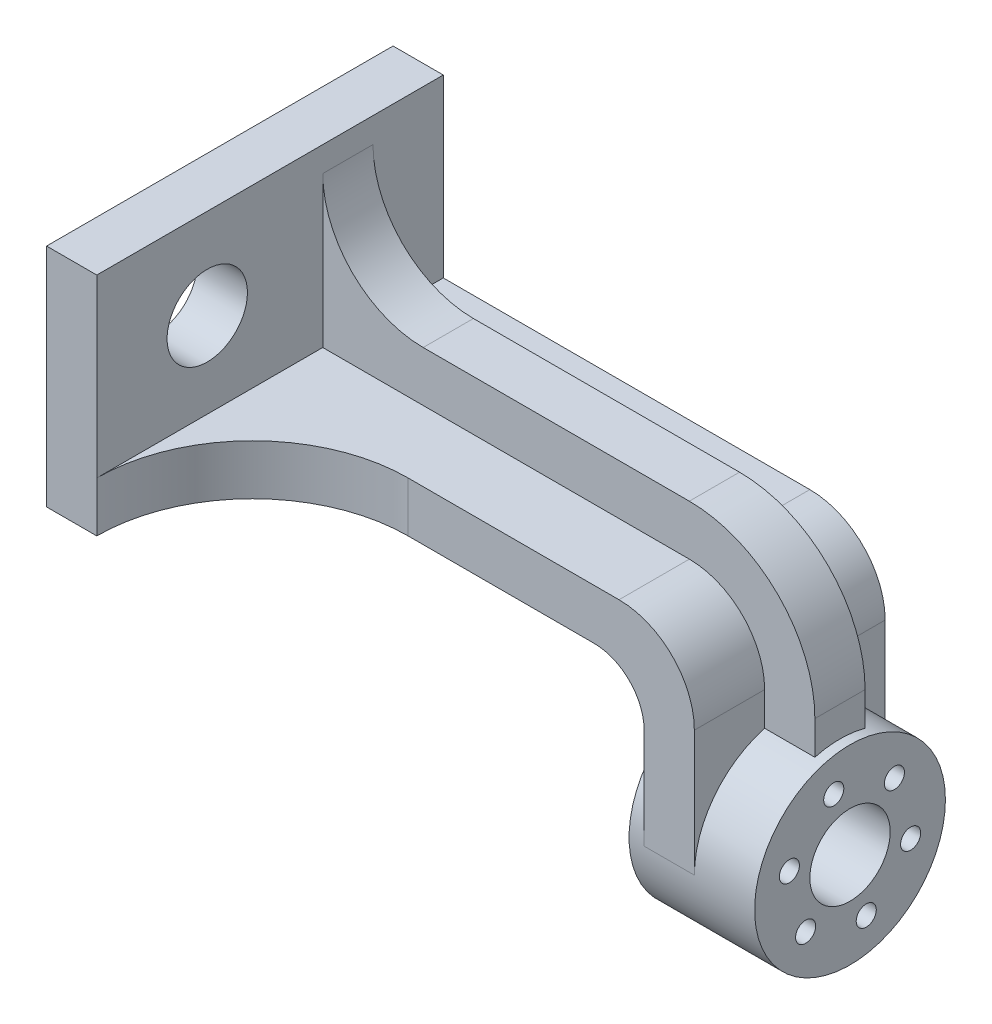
ISO-10303-21;
HEADER;
FILE_DESCRIPTION(('STEP AP214'),'2;1');
FILE_NAME('part.step','',(''),(''),'','','');
FILE_SCHEMA(('AUTOMOTIVE_DESIGN { 1 0 10303 214 1 1 1 1 }'));
ENDSEC;
DATA;
#1=APPLICATION_CONTEXT('core data for automotive mechanical design processes');
#2=APPLICATION_PROTOCOL_DEFINITION('international standard','automotive_design',2000,#1);
#3=PRODUCT_CONTEXT('',#1,'mechanical');
#4=PRODUCT('Part','Part','',(#3));
#5=PRODUCT_RELATED_PRODUCT_CATEGORY('part','',(#4));
#6=PRODUCT_DEFINITION_FORMATION('','',#4);
#7=PRODUCT_DEFINITION_CONTEXT('part definition',#1,'design');
#8=PRODUCT_DEFINITION('design','',#6,#7);
#9=PRODUCT_DEFINITION_SHAPE('','',#8);
#10=(LENGTH_UNIT() NAMED_UNIT(*) SI_UNIT(.MILLI.,.METRE.));
#11=(NAMED_UNIT(*) PLANE_ANGLE_UNIT() SI_UNIT($,.RADIAN.));
#12=(NAMED_UNIT(*) SI_UNIT($,.STERADIAN.) SOLID_ANGLE_UNIT());
#13=UNCERTAINTY_MEASURE_WITH_UNIT(LENGTH_MEASURE(1.E-05),#10,'distance_accuracy_value','');
#14=(GEOMETRIC_REPRESENTATION_CONTEXT(3) GLOBAL_UNCERTAINTY_ASSIGNED_CONTEXT((#13)) GLOBAL_UNIT_ASSIGNED_CONTEXT((#10,
#11,#12)) REPRESENTATION_CONTEXT('',''));
#15=CARTESIAN_POINT('',(0.,0.,0.));
#16=DIRECTION('',(0.,0.,1.));
#17=DIRECTION('',(1.,0.,0.));
#18=AXIS2_PLACEMENT_3D('',#15,#16,#17);
#19=CARTESIAN_POINT('',(98.,-52.5,3.5));
#20=DIRECTION('',(1.,0.,0.));
#21=DIRECTION('',(0.,0.,-1.));
#22=AXIS2_PLACEMENT_3D('',#19,#20,#21);
#23=PLANE('',#22);
#24=CARTESIAN_POINT('',(98.,-52.5,-15.5));
#25=DIRECTION('',(1.,0.,0.));
#26=DIRECTION('',(0.,0.,-1.));
#27=AXIS2_PLACEMENT_3D('',#24,#25,#26);
#28=CIRCLE('',#27,19.);
#29=CARTESIAN_POINT('',(98.,-34.1696972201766,-10.5));
#30=VERTEX_POINT('',#29);
#31=CARTESIAN_POINT('',(98.,-52.5,3.5));
#32=VERTEX_POINT('',#31);
#33=EDGE_CURVE('E283',#30,#32,#28,.T.);
#34=ORIENTED_EDGE('',*,*,#33,.F.);
#35=DIRECTION('',(0.,1.,0.));
#36=VECTOR('',#35,1.);
#37=CARTESIAN_POINT('',(98.,-52.5,-10.5));
#38=LINE('',#37,#36);
#39=CARTESIAN_POINT('',(98.,-27.5,-10.5));
#40=VERTEX_POINT('',#39);
#41=EDGE_CURVE('E214',#30,#40,#38,.T.);
#42=ORIENTED_EDGE('',*,*,#41,.T.);
#43=DIRECTION('',(0.,0.,-1.));
#44=VECTOR('',#43,1.);
#45=CARTESIAN_POINT('',(98.,-27.5,3.5));
#46=LINE('',#45,#44);
#47=CARTESIAN_POINT('',(98.,-27.5,3.5));
#48=VERTEX_POINT('',#47);
#49=EDGE_CURVE('E362',#40,#48,#46,.F.);
#50=ORIENTED_EDGE('',*,*,#49,.T.);
#51=DIRECTION('',(0.,-1.,0.));
#52=VECTOR('',#51,1.);
#53=CARTESIAN_POINT('',(98.,-52.5,3.5));
#54=LINE('',#53,#52);
#55=EDGE_CURVE('E293',#48,#32,#54,.T.);
#56=ORIENTED_EDGE('',*,*,#55,.T.);
#57=EDGE_LOOP('',(#34,#42,#50,#56));
#58=FACE_BOUND('',#57,.T.);
#59=ADVANCED_FACE('F32',(#58),#23,.T.);
#60=CARTESIAN_POINT('',(98.,-12.5,3.5));
#61=DIRECTION('',(0.,1.,0.));
#62=DIRECTION('',(-1.,0.,0.));
#63=AXIS2_PLACEMENT_3D('',#60,#61,#62);
#64=PLANE('',#63);
#65=DIRECTION('',(0.,0.,-1.));
#66=VECTOR('',#65,1.);
#67=CARTESIAN_POINT('',(83.,-12.5,3.5));
#68=LINE('',#67,#66);
#69=CARTESIAN_POINT('',(83.,-12.5,3.5));
#70=VERTEX_POINT('',#69);
#71=CARTESIAN_POINT('',(83.,-12.5,-10.5));
#72=VERTEX_POINT('',#71);
#73=EDGE_CURVE('E358',#70,#72,#68,.T.);
#74=ORIENTED_EDGE('',*,*,#73,.T.);
#75=DIRECTION('',(-1.,0.,0.));
#76=VECTOR('',#75,1.);
#77=CARTESIAN_POINT('',(98.,-12.5,-10.5));
#78=LINE('',#77,#76);
#79=CARTESIAN_POINT('',(10.,-12.5,-10.5));
#80=VERTEX_POINT('',#79);
#81=EDGE_CURVE('E211',#72,#80,#78,.T.);
#82=ORIENTED_EDGE('',*,*,#81,.T.);
#83=DIRECTION('',(0.,0.,-1.));
#84=VECTOR('',#83,1.);
#85=CARTESIAN_POINT('',(10.,-12.5,3.5));
#86=LINE('',#85,#84);
#87=CARTESIAN_POINT('',(10.,-12.5,34.5));
#88=VERTEX_POINT('',#87);
#89=EDGE_CURVE('E317',#88,#80,#86,.T.);
#90=ORIENTED_EDGE('',*,*,#89,.F.);
#91=CARTESIAN_POINT('',(41.,-12.5,34.5));
#92=DIRECTION('',(0.,1.,0.));
#93=DIRECTION('',(-1.,0.,0.));
#94=AXIS2_PLACEMENT_3D('',#91,#92,#93);
#95=CIRCLE('',#94,31.);
#96=CARTESIAN_POINT('',(41.,-12.5,3.5));
#97=VERTEX_POINT('',#96);
#98=EDGE_CURVE('E331',#88,#97,#95,.F.);
#99=ORIENTED_EDGE('',*,*,#98,.T.);
#100=DIRECTION('',(1.,0.,0.));
#101=VECTOR('',#100,1.);
#102=CARTESIAN_POINT('',(98.,-12.5,3.5));
#103=LINE('',#102,#101);
#104=EDGE_CURVE('E290',#97,#70,#103,.T.);
#105=ORIENTED_EDGE('',*,*,#104,.T.);
#106=EDGE_LOOP('',(#74,#82,#90,#99,#105));
#107=FACE_BOUND('',#106,.T.);
#108=ADVANCED_FACE('F407',(#107),#64,.T.);
#109=CARTESIAN_POINT('',(83.,-27.5,3.5));
#110=DIRECTION('',(0.,0.,-1.));
#111=DIRECTION('',(-1.,0.,0.));
#112=AXIS2_PLACEMENT_3D('',#109,#110,#111);
#113=CYLINDRICAL_SURFACE('',#112,15.);
#114=ORIENTED_EDGE('',*,*,#49,.F.);
#115=CARTESIAN_POINT('',(83.,-27.5,-10.5));
#116=DIRECTION('',(0.,0.,-1.));
#117=DIRECTION('',(-1.,0.,0.));
#118=AXIS2_PLACEMENT_3D('',#115,#116,#117);
#119=CIRCLE('',#118,15.);
#120=EDGE_CURVE('E203',#40,#72,#119,.F.);
#121=ORIENTED_EDGE('',*,*,#120,.T.);
#122=ORIENTED_EDGE('',*,*,#73,.F.);
#123=CARTESIAN_POINT('',(83.,-27.5,3.5));
#124=DIRECTION('',(0.,0.,1.));
#125=DIRECTION('',(1.,0.,0.));
#126=AXIS2_PLACEMENT_3D('',#123,#124,#125);
#127=CIRCLE('',#126,15.);
#128=EDGE_CURVE('E349',#48,#70,#127,.T.);
#129=ORIENTED_EDGE('',*,*,#128,.F.);
#130=EDGE_LOOP('',(#114,#121,#122,#129));
#131=FACE_BOUND('',#130,.T.);
#132=ADVANCED_FACE('F412',(#131),#113,.T.);
#133=CARTESIAN_POINT('',(10.,-22.5,-34.5));
#134=DIRECTION('',(0.,0.,1.));
#135=DIRECTION('',(1.,0.,0.));
#136=AXIS2_PLACEMENT_3D('',#133,#134,#135);
#137=PLANE('',#136);
#138=DIRECTION('',(1.,0.,0.));
#139=VECTOR('',#138,1.);
#140=CARTESIAN_POINT('',(98.,-12.5,-34.5));
#141=LINE('',#140,#139);
#142=CARTESIAN_POINT('',(10.,-12.5,-34.5));
#143=VERTEX_POINT('',#142);
#144=CARTESIAN_POINT('',(83.,-12.5,-34.5));
#145=VERTEX_POINT('',#144);
#146=EDGE_CURVE('E289',#143,#145,#141,.T.);
#147=ORIENTED_EDGE('',*,*,#146,.T.);
#148=CARTESIAN_POINT('',(83.,-27.5,-34.5));
#149=DIRECTION('',(0.,0.,1.));
#150=DIRECTION('',(1.,0.,0.));
#151=AXIS2_PLACEMENT_3D('',#148,#149,#150);
#152=CIRCLE('',#151,15.);
#153=CARTESIAN_POINT('',(98.,-27.5,-34.5));
#154=VERTEX_POINT('',#153);
#155=EDGE_CURVE('E360',#145,#154,#152,.F.);
#156=ORIENTED_EDGE('',*,*,#155,.T.);
#157=DIRECTION('',(0.,-1.,0.));
#158=VECTOR('',#157,1.);
#159=CARTESIAN_POINT('',(98.,-52.5,-34.5));
#160=LINE('',#159,#158);
#161=CARTESIAN_POINT('',(98.,-52.5,-34.5));
#162=VERTEX_POINT('',#161);
#163=EDGE_CURVE('E304',#154,#162,#160,.T.);
#164=ORIENTED_EDGE('',*,*,#163,.T.);
#165=DIRECTION('',(-1.,0.,0.));
#166=VECTOR('',#165,1.);
#167=CARTESIAN_POINT('',(88.,-52.5,-34.5));
#168=LINE('',#167,#166);
#169=CARTESIAN_POINT('',(88.,-52.5,-34.5));
#170=VERTEX_POINT('',#169);
#171=EDGE_CURVE('E306',#162,#170,#168,.T.);
#172=ORIENTED_EDGE('',*,*,#171,.T.);
#173=DIRECTION('',(0.,1.,0.));
#174=VECTOR('',#173,1.);
#175=CARTESIAN_POINT('',(88.,-22.5,-34.5));
#176=LINE('',#175,#174);
#177=CARTESIAN_POINT('',(88.,-32.5,-34.5));
#178=VERTEX_POINT('',#177);
#179=EDGE_CURVE('E294',#170,#178,#176,.T.);
#180=ORIENTED_EDGE('',*,*,#179,.T.);
#181=CARTESIAN_POINT('',(78.,-32.5,-34.5));
#182=DIRECTION('',(0.,0.,1.));
#183=DIRECTION('',(1.,0.,0.));
#184=AXIS2_PLACEMENT_3D('',#181,#182,#183);
#185=CIRCLE('',#184,10.);
#186=CARTESIAN_POINT('',(78.,-22.5,-34.5));
#187=VERTEX_POINT('',#186);
#188=EDGE_CURVE('E341',#178,#187,#185,.T.);
#189=ORIENTED_EDGE('',*,*,#188,.T.);
#190=DIRECTION('',(-1.,0.,0.));
#191=VECTOR('',#190,1.);
#192=CARTESIAN_POINT('',(10.,-22.5,-34.5));
#193=LINE('',#192,#191);
#194=CARTESIAN_POINT('',(0.,-22.5,-34.5));
#195=VERTEX_POINT('',#194);
#196=EDGE_CURVE('E527',#187,#195,#193,.T.);
#197=ORIENTED_EDGE('',*,*,#196,.T.);
#198=DIRECTION('',(0.,1.,0.));
#199=VECTOR('',#198,1.);
#200=CARTESIAN_POINT('',(0.,-22.5,-34.5));
#201=LINE('',#200,#199);
#202=CARTESIAN_POINT('',(0.,22.5,-34.5));
#203=VERTEX_POINT('',#202);
#204=EDGE_CURVE('E529',#195,#203,#201,.T.);
#205=ORIENTED_EDGE('',*,*,#204,.T.);
#206=DIRECTION('',(-1.,0.,0.));
#207=VECTOR('',#206,1.);
#208=CARTESIAN_POINT('',(10.,22.5,-34.5));
#209=LINE('',#208,#207);
#210=CARTESIAN_POINT('',(10.,22.5,-34.5));
#211=VERTEX_POINT('',#210);
#212=EDGE_CURVE('E544',#211,#203,#209,.T.);
#213=ORIENTED_EDGE('',*,*,#212,.F.);
#214=DIRECTION('',(0.,1.,0.));
#215=VECTOR('',#214,1.);
#216=CARTESIAN_POINT('',(10.,-22.5,-34.5));
#217=LINE('',#216,#215);
#218=EDGE_CURVE('E387',#143,#211,#217,.T.);
#219=ORIENTED_EDGE('',*,*,#218,.F.);
#220=EDGE_LOOP('',(#147,#156,#164,#172,#180,#189,#197,#205,#213,#219));
#221=FACE_BOUND('',#220,.T.);
#222=ADVANCED_FACE('F500',(#221),#137,.F.);
#223=CARTESIAN_POINT('',(10.,22.5,34.5));
#224=DIRECTION('',(0.,-1.,0.));
#225=DIRECTION('',(0.,0.,-1.));
#226=AXIS2_PLACEMENT_3D('',#223,#224,#225);
#227=PLANE('',#226);
#228=DIRECTION('',(0.,0.,1.));
#229=VECTOR('',#228,1.);
#230=CARTESIAN_POINT('',(0.,22.5,34.5));
#231=LINE('',#230,#229);
#232=CARTESIAN_POINT('',(0.,22.5,34.5));
#233=VERTEX_POINT('',#232);
#234=EDGE_CURVE('E532',#203,#233,#231,.T.);
#235=ORIENTED_EDGE('',*,*,#234,.T.);
#236=DIRECTION('',(-1.,0.,0.));
#237=VECTOR('',#236,1.);
#238=CARTESIAN_POINT('',(10.,22.5,34.5));
#239=LINE('',#238,#237);
#240=CARTESIAN_POINT('',(10.,22.5,34.5));
#241=VERTEX_POINT('',#240);
#242=EDGE_CURVE('E541',#241,#233,#239,.T.);
#243=ORIENTED_EDGE('',*,*,#242,.F.);
#244=DIRECTION('',(0.,0.,1.));
#245=VECTOR('',#244,1.);
#246=CARTESIAN_POINT('',(10.,22.5,34.5));
#247=LINE('',#246,#245);
#248=EDGE_CURVE('E525',#211,#241,#247,.T.);
#249=ORIENTED_EDGE('',*,*,#248,.F.);
#250=ORIENTED_EDGE('',*,*,#212,.T.);
#251=EDGE_LOOP('',(#235,#243,#249,#250));
#252=FACE_BOUND('',#251,.T.);
#253=ADVANCED_FACE('F496',(#252),#227,.F.);
#254=CARTESIAN_POINT('',(10.,-22.5,34.5));
#255=DIRECTION('',(0.,0.,-1.));
#256=DIRECTION('',(-1.,0.,0.));
#257=AXIS2_PLACEMENT_3D('',#254,#255,#256);
#258=PLANE('',#257);
#259=DIRECTION('',(0.,-1.,0.));
#260=VECTOR('',#259,1.);
#261=CARTESIAN_POINT('',(0.,-22.5,34.5));
#262=LINE('',#261,#260);
#263=CARTESIAN_POINT('',(0.,-22.5,34.5));
#264=VERTEX_POINT('',#263);
#265=EDGE_CURVE('E534',#233,#264,#262,.T.);
#266=ORIENTED_EDGE('',*,*,#265,.T.);
#267=DIRECTION('',(-1.,0.,0.));
#268=VECTOR('',#267,1.);
#269=CARTESIAN_POINT('',(10.,-22.5,34.5));
#270=LINE('',#269,#268);
#271=CARTESIAN_POINT('',(10.,-22.5,34.5));
#272=VERTEX_POINT('',#271);
#273=EDGE_CURVE('E539',#272,#264,#270,.T.);
#274=ORIENTED_EDGE('',*,*,#273,.F.);
#275=DIRECTION('',(0.,-1.,0.));
#276=VECTOR('',#275,1.);
#277=CARTESIAN_POINT('',(10.,-22.5,34.5));
#278=LINE('',#277,#276);
#279=EDGE_CURVE('E521',#88,#272,#278,.T.);
#280=ORIENTED_EDGE('',*,*,#279,.F.);
#281=EDGE_CURVE('E524',#241,#88,#278,.T.);
#282=ORIENTED_EDGE('',*,*,#281,.F.);
#283=ORIENTED_EDGE('',*,*,#242,.T.);
#284=EDGE_LOOP('',(#266,#274,#280,#282,#283));
#285=FACE_BOUND('',#284,.T.);
#286=ADVANCED_FACE('F491',(#285),#258,.F.);
#287=CARTESIAN_POINT('',(10.,-22.5,34.5));
#288=DIRECTION('',(0.,1.,0.));
#289=DIRECTION('',(0.,0.,1.));
#290=AXIS2_PLACEMENT_3D('',#287,#288,#289);
#291=PLANE('',#290);
#292=DIRECTION('',(0.,0.,-1.));
#293=VECTOR('',#292,1.);
#294=CARTESIAN_POINT('',(78.,-22.5,34.5));
#295=LINE('',#294,#293);
#296=CARTESIAN_POINT('',(78.,-22.5,3.5));
#297=VERTEX_POINT('',#296);
#298=EDGE_CURVE('E345',#187,#297,#295,.F.);
#299=ORIENTED_EDGE('',*,*,#298,.T.);
#300=DIRECTION('',(-1.,0.,0.));
#301=VECTOR('',#300,1.);
#302=CARTESIAN_POINT('',(10.,-22.5,3.5));
#303=LINE('',#302,#301);
#304=CARTESIAN_POINT('',(41.,-22.5,3.5));
#305=VERTEX_POINT('',#304);
#306=EDGE_CURVE('E303',#297,#305,#303,.T.);
#307=ORIENTED_EDGE('',*,*,#306,.T.);
#308=CARTESIAN_POINT('',(41.,-22.5,34.5));
#309=DIRECTION('',(0.,1.,0.));
#310=DIRECTION('',(0.,0.,1.));
#311=AXIS2_PLACEMENT_3D('',#308,#309,#310);
#312=CIRCLE('',#311,31.);
#313=EDGE_CURVE('E324',#305,#272,#312,.T.);
#314=ORIENTED_EDGE('',*,*,#313,.T.);
#315=ORIENTED_EDGE('',*,*,#273,.T.);
#316=DIRECTION('',(0.,0.,-1.));
#317=VECTOR('',#316,1.);
#318=CARTESIAN_POINT('',(0.,-22.5,34.5));
#319=LINE('',#318,#317);
#320=EDGE_CURVE('E536',#264,#195,#319,.T.);
#321=ORIENTED_EDGE('',*,*,#320,.T.);
#322=ORIENTED_EDGE('',*,*,#196,.F.);
#323=EDGE_LOOP('',(#299,#307,#314,#315,#321,#322));
#324=FACE_BOUND('',#323,.T.);
#325=ADVANCED_FACE('F486',(#324),#291,.F.);
#326=CARTESIAN_POINT('',(10.,22.5,-34.5));
#327=DIRECTION('',(-1.,0.,0.));
#328=DIRECTION('',(0.,0.,1.));
#329=AXIS2_PLACEMENT_3D('',#326,#327,#328);
#330=PLANE('',#329);
#331=CARTESIAN_POINT('',(10.,4.5,12.5));
#332=DIRECTION('',(1.,0.,0.));
#333=DIRECTION('',(0.,0.,-1.));
#334=AXIS2_PLACEMENT_3D('',#331,#332,#333);
#335=CIRCLE('',#334,8.);
#336=CARTESIAN_POINT('',(10.,4.5,4.5));
#337=VERTEX_POINT('',#336);
#338=EDGE_CURVE('E230',#337,#337,#335,.T.);
#339=ORIENTED_EDGE('',*,*,#338,.F.);
#340=EDGE_LOOP('',(#339));
#341=FACE_BOUND('',#340,.T.);
#342=DIRECTION('',(0.,0.,1.));
#343=VECTOR('',#342,1.);
#344=CARTESIAN_POINT('',(10.,17.5,-34.5));
#345=LINE('',#344,#343);
#346=CARTESIAN_POINT('',(10.,17.5,-10.5));
#347=VERTEX_POINT('',#346);
#348=CARTESIAN_POINT('',(10.,17.5,-20.5));
#349=VERTEX_POINT('',#348);
#350=EDGE_CURVE('E326',#347,#349,#345,.F.);
#351=ORIENTED_EDGE('',*,*,#350,.T.);
#352=DIRECTION('',(0.,-1.,0.));
#353=VECTOR('',#352,1.);
#354=CARTESIAN_POINT('',(10.,22.5,-20.5));
#355=LINE('',#354,#353);
#356=CARTESIAN_POINT('',(10.,-12.5,-20.5));
#357=VERTEX_POINT('',#356);
#358=EDGE_CURVE('E220',#349,#357,#355,.T.);
#359=ORIENTED_EDGE('',*,*,#358,.T.);
#360=EDGE_CURVE('E321',#357,#143,#86,.T.);
#361=ORIENTED_EDGE('',*,*,#360,.T.);
#362=ORIENTED_EDGE('',*,*,#218,.T.);
#363=ORIENTED_EDGE('',*,*,#248,.T.);
#364=ORIENTED_EDGE('',*,*,#281,.T.);
#365=ORIENTED_EDGE('',*,*,#89,.T.);
#366=DIRECTION('',(0.,-1.,0.));
#367=VECTOR('',#366,1.);
#368=CARTESIAN_POINT('',(10.,22.5,-10.5));
#369=LINE('',#368,#367);
#370=EDGE_CURVE('E208',#347,#80,#369,.T.);
#371=ORIENTED_EDGE('',*,*,#370,.F.);
#372=EDGE_LOOP('',(#351,#359,#361,#362,#363,#364,#365,#371));
#373=FACE_BOUND('',#372,.T.);
#374=ADVANCED_FACE('F386',(#341,#373),#330,.F.);
#375=CARTESIAN_POINT('',(0.,22.5,-34.5));
#376=DIRECTION('',(-1.,0.,0.));
#377=DIRECTION('',(0.,0.,1.));
#378=AXIS2_PLACEMENT_3D('',#375,#376,#377);
#379=PLANE('',#378);
#380=ORIENTED_EDGE('',*,*,#204,.F.);
#381=ORIENTED_EDGE('',*,*,#320,.F.);
#382=ORIENTED_EDGE('',*,*,#265,.F.);
#383=ORIENTED_EDGE('',*,*,#234,.F.);
#384=EDGE_LOOP('',(#380,#381,#382,#383));
#385=FACE_BOUND('',#384,.T.);
#386=CARTESIAN_POINT('',(0.,4.5,12.5));
#387=DIRECTION('',(-1.,0.,0.));
#388=DIRECTION('',(0.,0.,1.));
#389=AXIS2_PLACEMENT_3D('',#386,#387,#388);
#390=CIRCLE('',#389,8.);
#391=CARTESIAN_POINT('',(0.,4.5,20.5));
#392=VERTEX_POINT('',#391);
#393=EDGE_CURVE('E229',#392,#392,#390,.F.);
#394=ORIENTED_EDGE('',*,*,#393,.T.);
#395=EDGE_LOOP('',(#394));
#396=FACE_BOUND('',#395,.T.);
#397=ADVANCED_FACE('F423',(#385,#396),#379,.T.);
#398=CARTESIAN_POINT('',(88.,-22.5,3.5));
#399=DIRECTION('',(-1.,0.,0.));
#400=DIRECTION('',(0.,0.,1.));
#401=AXIS2_PLACEMENT_3D('',#398,#399,#400);
#402=PLANE('',#401);
#403=ORIENTED_EDGE('',*,*,#179,.F.);
#404=CARTESIAN_POINT('',(88.,-52.5,-15.5));
#405=DIRECTION('',(-1.,0.,0.));
#406=DIRECTION('',(0.,0.,1.));
#407=AXIS2_PLACEMENT_3D('',#404,#405,#406);
#408=CIRCLE('',#407,19.);
#409=CARTESIAN_POINT('',(88.,-52.5,3.5));
#410=VERTEX_POINT('',#409);
#411=EDGE_CURVE('E287',#410,#170,#408,.T.);
#412=ORIENTED_EDGE('',*,*,#411,.F.);
#413=DIRECTION('',(0.,1.,0.));
#414=VECTOR('',#413,1.);
#415=CARTESIAN_POINT('',(88.,-22.5,3.5));
#416=LINE('',#415,#414);
#417=CARTESIAN_POINT('',(88.,-32.5,3.5));
#418=VERTEX_POINT('',#417);
#419=EDGE_CURVE('E300',#410,#418,#416,.T.);
#420=ORIENTED_EDGE('',*,*,#419,.T.);
#421=DIRECTION('',(0.,0.,-1.));
#422=VECTOR('',#421,1.);
#423=CARTESIAN_POINT('',(88.,-32.5,3.5));
#424=LINE('',#423,#422);
#425=EDGE_CURVE('E347',#418,#178,#424,.T.);
#426=ORIENTED_EDGE('',*,*,#425,.T.);
#427=EDGE_LOOP('',(#403,#412,#420,#426));
#428=FACE_BOUND('',#427,.T.);
#429=ADVANCED_FACE('F417',(#428),#402,.T.);
#430=DIRECTION('',(0.,1.,0.));
#431=VECTOR('',#430,1.);
#432=CARTESIAN_POINT('',(98.,-52.5,-20.5));
#433=LINE('',#432,#431);
#434=CARTESIAN_POINT('',(98.,-34.1696972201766,-20.5));
#435=VERTEX_POINT('',#434);
#436=CARTESIAN_POINT('',(98.,-27.5,-20.5));
#437=VERTEX_POINT('',#436);
#438=EDGE_CURVE('E224',#435,#437,#433,.T.);
#439=ORIENTED_EDGE('',*,*,#438,.F.);
#440=EDGE_CURVE('E284',#162,#435,#28,.T.);
#441=ORIENTED_EDGE('',*,*,#440,.F.);
#442=ORIENTED_EDGE('',*,*,#163,.F.);
#443=EDGE_CURVE('E353',#154,#437,#46,.F.);
#444=ORIENTED_EDGE('',*,*,#443,.T.);
#445=EDGE_LOOP('',(#439,#441,#442,#444));
#446=FACE_BOUND('',#445,.T.);
#447=ADVANCED_FACE('F374',(#446),#23,.T.);
#448=DIRECTION('',(-1.,0.,0.));
#449=VECTOR('',#448,1.);
#450=CARTESIAN_POINT('',(98.,-12.5,-20.5));
#451=LINE('',#450,#449);
#452=CARTESIAN_POINT('',(83.,-12.5,-20.5));
#453=VERTEX_POINT('',#452);
#454=EDGE_CURVE('E222',#453,#357,#451,.T.);
#455=ORIENTED_EDGE('',*,*,#454,.F.);
#456=EDGE_CURVE('E361',#453,#145,#68,.T.);
#457=ORIENTED_EDGE('',*,*,#456,.T.);
#458=ORIENTED_EDGE('',*,*,#146,.F.);
#459=ORIENTED_EDGE('',*,*,#360,.F.);
#460=EDGE_LOOP('',(#455,#457,#458,#459));
#461=FACE_BOUND('',#460,.T.);
#462=ADVANCED_FACE('F383',(#461),#64,.T.);
#463=CARTESIAN_POINT('',(10.,-22.5,3.5));
#464=DIRECTION('',(0.,0.,1.));
#465=DIRECTION('',(1.,0.,0.));
#466=AXIS2_PLACEMENT_3D('',#463,#464,#465);
#467=PLANE('',#466);
#468=ORIENTED_EDGE('',*,*,#55,.F.);
#469=ORIENTED_EDGE('',*,*,#128,.T.);
#470=ORIENTED_EDGE('',*,*,#104,.F.);
#471=DIRECTION('',(0.,1.,0.));
#472=VECTOR('',#471,1.);
#473=CARTESIAN_POINT('',(41.,-22.5,3.5));
#474=LINE('',#473,#472);
#475=EDGE_CURVE('E351',#97,#305,#474,.F.);
#476=ORIENTED_EDGE('',*,*,#475,.T.);
#477=ORIENTED_EDGE('',*,*,#306,.F.);
#478=CARTESIAN_POINT('',(78.,-32.5,3.5));
#479=DIRECTION('',(0.,0.,1.));
#480=DIRECTION('',(1.,0.,0.));
#481=AXIS2_PLACEMENT_3D('',#478,#479,#480);
#482=CIRCLE('',#481,10.);
#483=EDGE_CURVE('E337',#297,#418,#482,.F.);
#484=ORIENTED_EDGE('',*,*,#483,.T.);
#485=ORIENTED_EDGE('',*,*,#419,.F.);
#486=DIRECTION('',(-1.,0.,0.));
#487=VECTOR('',#486,1.);
#488=CARTESIAN_POINT('',(88.,-52.5,3.5));
#489=LINE('',#488,#487);
#490=EDGE_CURVE('E297',#32,#410,#489,.T.);
#491=ORIENTED_EDGE('',*,*,#490,.F.);
#492=EDGE_LOOP('',(#468,#469,#470,#476,#477,#484,#485,#491));
#493=FACE_BOUND('',#492,.T.);
#494=ADVANCED_FACE('F422',(#493),#467,.T.);
#495=CARTESIAN_POINT('',(85.,-52.5,-15.5));
#496=DIRECTION('',(1.,0.,0.));
#497=DIRECTION('',(0.,0.,-1.));
#498=AXIS2_PLACEMENT_3D('',#495,#496,#497);
#499=CYLINDRICAL_SURFACE('',#498,19.);
#500=CARTESIAN_POINT('',(85.,-52.5,-15.5));
#501=DIRECTION('',(1.,0.,0.));
#502=DIRECTION('',(0.,0.,-1.));
#503=AXIS2_PLACEMENT_3D('',#500,#501,#502);
#504=CIRCLE('',#503,19.);
#505=CARTESIAN_POINT('',(85.,-52.5,-34.5));
#506=VERTEX_POINT('',#505);
#507=EDGE_CURVE('E280',#506,#506,#504,.T.);
#508=ORIENTED_EDGE('',*,*,#507,.T.);
#509=EDGE_LOOP('',(#508));
#510=FACE_BOUND('',#509,.T.);
#511=ORIENTED_EDGE('',*,*,#411,.T.);
#512=ORIENTED_EDGE('',*,*,#171,.F.);
#513=ORIENTED_EDGE('',*,*,#440,.T.);
#514=DIRECTION('',(1.,0.,0.));
#515=VECTOR('',#514,1.);
#516=CARTESIAN_POINT('',(85.,-34.1696972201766,-20.5));
#517=LINE('',#516,#515);
#518=CARTESIAN_POINT('',(108.,-34.1696972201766,-20.5));
#519=VERTEX_POINT('',#518);
#520=EDGE_CURVE('E218',#519,#435,#517,.F.);
#521=ORIENTED_EDGE('',*,*,#520,.F.);
#522=CARTESIAN_POINT('',(108.,-52.5,-15.5));
#523=DIRECTION('',(-1.,0.,0.));
#524=DIRECTION('',(0.,0.,1.));
#525=AXIS2_PLACEMENT_3D('',#522,#523,#524);
#526=CIRCLE('',#525,19.);
#527=CARTESIAN_POINT('',(108.,-34.1696972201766,-10.5));
#528=VERTEX_POINT('',#527);
#529=EDGE_CURVE('E180',#528,#519,#526,.T.);
#530=ORIENTED_EDGE('',*,*,#529,.F.);
#531=DIRECTION('',(1.,0.,0.));
#532=VECTOR('',#531,1.);
#533=CARTESIAN_POINT('',(85.,-34.1696972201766,-10.5));
#534=LINE('',#533,#532);
#535=EDGE_CURVE('E204',#528,#30,#534,.F.);
#536=ORIENTED_EDGE('',*,*,#535,.T.);
#537=ORIENTED_EDGE('',*,*,#33,.T.);
#538=ORIENTED_EDGE('',*,*,#490,.T.);
#539=EDGE_LOOP('',(#511,#512,#513,#521,#530,#536,#537,#538));
#540=FACE_BOUND('',#539,.T.);
#541=CARTESIAN_POINT('',(110.,-52.5,-15.5));
#542=DIRECTION('',(1.,0.,0.));
#543=DIRECTION('',(0.,0.,-1.));
#544=AXIS2_PLACEMENT_3D('',#541,#542,#543);
#545=CIRCLE('',#544,19.);
#546=CARTESIAN_POINT('',(110.,-52.5,-34.5));
#547=VERTEX_POINT('',#546);
#548=EDGE_CURVE('E277',#547,#547,#545,.T.);
#549=ORIENTED_EDGE('',*,*,#548,.F.);
#550=EDGE_LOOP('',(#549));
#551=FACE_BOUND('',#550,.T.);
#552=ADVANCED_FACE('F434',(#510,#540,#551),#499,.T.);
#553=CARTESIAN_POINT('',(85.,-52.5,-15.5));
#554=DIRECTION('',(1.,0.,0.));
#555=DIRECTION('',(0.,0.,-1.));
#556=AXIS2_PLACEMENT_3D('',#553,#554,#555);
#557=PLANE('',#556);
#558=CARTESIAN_POINT('',(85.,-64.5740728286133,-18.7352380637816));
#559=DIRECTION('',(1.,0.,0.));
#560=DIRECTION('',(0.,0.,-1.));
#561=AXIS2_PLACEMENT_3D('',#558,#559,#560);
#562=CIRCLE('',#561,2.);
#563=CARTESIAN_POINT('',(85.,-64.5740728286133,-20.7352380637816));
#564=VERTEX_POINT('',#563);
#565=EDGE_CURVE('E244',#564,#564,#562,.F.);
#566=ORIENTED_EDGE('',*,*,#565,.F.);
#567=EDGE_LOOP('',(#566));
#568=FACE_BOUND('',#567,.T.);
#569=CARTESIAN_POINT('',(85.,-52.5,-15.5));
#570=DIRECTION('',(1.,0.,0.));
#571=DIRECTION('',(0.,0.,-1.));
#572=AXIS2_PLACEMENT_3D('',#569,#570,#571);
#573=CIRCLE('',#572,8.);
#574=CARTESIAN_POINT('',(85.,-52.5,-23.5));
#575=VERTEX_POINT('',#574);
#576=EDGE_CURVE('E274',#575,#575,#573,.F.);
#577=ORIENTED_EDGE('',*,*,#576,.F.);
#578=EDGE_LOOP('',(#577));
#579=FACE_BOUND('',#578,.T.);
#580=CARTESIAN_POINT('',(85.,-55.7352380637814,-27.5740728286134));
#581=DIRECTION('',(1.,0.,0.));
#582=DIRECTION('',(0.,0.,-1.));
#583=AXIS2_PLACEMENT_3D('',#580,#581,#582);
#584=CIRCLE('',#583,2.);
#585=CARTESIAN_POINT('',(85.,-55.7352380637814,-29.5740728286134));
#586=VERTEX_POINT('',#585);
#587=EDGE_CURVE('E238',#586,#586,#584,.F.);
#588=ORIENTED_EDGE('',*,*,#587,.F.);
#589=EDGE_LOOP('',(#588));
#590=FACE_BOUND('',#589,.T.);
#591=ORIENTED_EDGE('',*,*,#507,.F.);
#592=EDGE_LOOP('',(#591));
#593=FACE_BOUND('',#592,.T.);
#594=CARTESIAN_POINT('',(85.,-43.6611652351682,-24.3388347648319));
#595=DIRECTION('',(1.,0.,0.));
#596=DIRECTION('',(0.,0.,-1.));
#597=AXIS2_PLACEMENT_3D('',#594,#595,#596);
#598=CIRCLE('',#597,2.);
#599=CARTESIAN_POINT('',(85.,-43.6611652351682,-26.3388347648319));
#600=VERTEX_POINT('',#599);
#601=EDGE_CURVE('E268',#600,#600,#598,.F.);
#602=ORIENTED_EDGE('',*,*,#601,.F.);
#603=EDGE_LOOP('',(#602));
#604=FACE_BOUND('',#603,.T.);
#605=CARTESIAN_POINT('',(85.,-40.4259271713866,-12.2647619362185));
#606=DIRECTION('',(1.,0.,0.));
#607=DIRECTION('',(0.,0.,-1.));
#608=AXIS2_PLACEMENT_3D('',#605,#606,#607);
#609=CIRCLE('',#608,2.);
#610=CARTESIAN_POINT('',(85.,-40.4259271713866,-14.2647619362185));
#611=VERTEX_POINT('',#610);
#612=EDGE_CURVE('E262',#611,#611,#609,.F.);
#613=ORIENTED_EDGE('',*,*,#612,.F.);
#614=EDGE_LOOP('',(#613));
#615=FACE_BOUND('',#614,.T.);
#616=CARTESIAN_POINT('',(85.,-49.2647619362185,-3.42592717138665));
#617=DIRECTION('',(1.,0.,0.));
#618=DIRECTION('',(0.,0.,-1.));
#619=AXIS2_PLACEMENT_3D('',#616,#617,#618);
#620=CIRCLE('',#619,2.);
#621=CARTESIAN_POINT('',(85.,-49.2647619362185,-5.42592717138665));
#622=VERTEX_POINT('',#621);
#623=EDGE_CURVE('E256',#622,#622,#620,.F.);
#624=ORIENTED_EDGE('',*,*,#623,.F.);
#625=EDGE_LOOP('',(#624));
#626=FACE_BOUND('',#625,.T.);
#627=CARTESIAN_POINT('',(85.,-61.3388347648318,-6.66116523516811));
#628=DIRECTION('',(1.,0.,0.));
#629=DIRECTION('',(0.,0.,-1.));
#630=AXIS2_PLACEMENT_3D('',#627,#628,#629);
#631=CIRCLE('',#630,2.);
#632=CARTESIAN_POINT('',(85.,-61.3388347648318,-8.66116523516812));
#633=VERTEX_POINT('',#632);
#634=EDGE_CURVE('E250',#633,#633,#631,.F.);
#635=ORIENTED_EDGE('',*,*,#634,.F.);
#636=EDGE_LOOP('',(#635));
#637=FACE_BOUND('',#636,.T.);
#638=ADVANCED_FACE('F438',(#568,#579,#590,#593,#604,#615,#626,#637),#557,.F.);
#639=CARTESIAN_POINT('',(110.,-52.5,-15.5));
#640=DIRECTION('',(1.,0.,0.));
#641=DIRECTION('',(0.,0.,-1.));
#642=AXIS2_PLACEMENT_3D('',#639,#640,#641);
#643=PLANE('',#642);
#644=CARTESIAN_POINT('',(110.,-55.7352380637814,-27.5740728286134));
#645=DIRECTION('',(1.,0.,0.));
#646=DIRECTION('',(0.,-0.866025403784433,-0.50000000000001));
#647=AXIS2_PLACEMENT_3D('',#644,#645,#646);
#648=CIRCLE('',#647,2.);
#649=CARTESIAN_POINT('',(110.,-55.7352380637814,-29.5740728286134));
#650=VERTEX_POINT('',#649);
#651=EDGE_CURVE('E233',#650,#650,#648,.T.);
#652=ORIENTED_EDGE('',*,*,#651,.F.);
#653=EDGE_LOOP('',(#652));
#654=FACE_BOUND('',#653,.T.);
#655=CARTESIAN_POINT('',(110.,-64.5740728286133,-18.7352380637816));
#656=DIRECTION('',(1.,0.,0.));
#657=DIRECTION('',(0.,-0.866025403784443,0.499999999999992));
#658=AXIS2_PLACEMENT_3D('',#655,#656,#657);
#659=CIRCLE('',#658,2.);
#660=CARTESIAN_POINT('',(110.,-64.5740728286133,-20.7352380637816));
#661=VERTEX_POINT('',#660);
#662=EDGE_CURVE('E241',#661,#661,#659,.T.);
#663=ORIENTED_EDGE('',*,*,#662,.F.);
#664=EDGE_LOOP('',(#663));
#665=FACE_BOUND('',#664,.T.);
#666=CARTESIAN_POINT('',(110.,-61.3388347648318,-6.66116523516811));
#667=DIRECTION('',(1.,0.,0.));
#668=DIRECTION('',(0.,0.,1.));
#669=AXIS2_PLACEMENT_3D('',#666,#667,#668);
#670=CIRCLE('',#669,2.);
#671=CARTESIAN_POINT('',(110.,-61.3388347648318,-8.66116523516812));
#672=VERTEX_POINT('',#671);
#673=EDGE_CURVE('E247',#672,#672,#670,.T.);
#674=ORIENTED_EDGE('',*,*,#673,.F.);
#675=EDGE_LOOP('',(#674));
#676=FACE_BOUND('',#675,.T.);
#677=CARTESIAN_POINT('',(110.,-49.2647619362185,-3.42592717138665));
#678=DIRECTION('',(1.,0.,0.));
#679=DIRECTION('',(0.,0.866025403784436,0.500000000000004));
#680=AXIS2_PLACEMENT_3D('',#677,#678,#679);
#681=CIRCLE('',#680,2.);
#682=CARTESIAN_POINT('',(110.,-49.2647619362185,-5.42592717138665));
#683=VERTEX_POINT('',#682);
#684=EDGE_CURVE('E253',#683,#683,#681,.T.);
#685=ORIENTED_EDGE('',*,*,#684,.F.);
#686=EDGE_LOOP('',(#685));
#687=FACE_BOUND('',#686,.T.);
#688=CARTESIAN_POINT('',(110.,-40.4259271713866,-12.2647619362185));
#689=DIRECTION('',(1.,0.,0.));
#690=DIRECTION('',(0.,0.86602540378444,-0.499999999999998));
#691=AXIS2_PLACEMENT_3D('',#688,#689,#690);
#692=CIRCLE('',#691,2.);
#693=CARTESIAN_POINT('',(110.,-40.4259271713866,-14.2647619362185));
#694=VERTEX_POINT('',#693);
#695=EDGE_CURVE('E259',#694,#694,#692,.T.);
#696=ORIENTED_EDGE('',*,*,#695,.F.);
#697=EDGE_LOOP('',(#696));
#698=FACE_BOUND('',#697,.T.);
#699=CARTESIAN_POINT('',(110.,-43.6611652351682,-24.3388347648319));
#700=DIRECTION('',(1.,0.,0.));
#701=DIRECTION('',(0.,0.,-1.));
#702=AXIS2_PLACEMENT_3D('',#699,#700,#701);
#703=CIRCLE('',#702,2.);
#704=CARTESIAN_POINT('',(110.,-43.6611652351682,-26.3388347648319));
#705=VERTEX_POINT('',#704);
#706=EDGE_CURVE('E265',#705,#705,#703,.T.);
#707=ORIENTED_EDGE('',*,*,#706,.F.);
#708=EDGE_LOOP('',(#707));
#709=FACE_BOUND('',#708,.T.);
#710=CARTESIAN_POINT('',(110.,-52.5,-15.5));
#711=DIRECTION('',(1.,0.,0.));
#712=DIRECTION('',(0.,0.,-1.));
#713=AXIS2_PLACEMENT_3D('',#710,#711,#712);
#714=CIRCLE('',#713,8.);
#715=CARTESIAN_POINT('',(110.,-52.5,-23.5));
#716=VERTEX_POINT('',#715);
#717=EDGE_CURVE('E271',#716,#716,#714,.T.);
#718=ORIENTED_EDGE('',*,*,#717,.F.);
#719=EDGE_LOOP('',(#718));
#720=FACE_BOUND('',#719,.T.);
#721=ORIENTED_EDGE('',*,*,#548,.T.);
#722=EDGE_LOOP('',(#721));
#723=FACE_BOUND('',#722,.T.);
#724=ADVANCED_FACE('F442',(#654,#665,#676,#687,#698,#709,#720,#723),#643,.T.);
#725=CARTESIAN_POINT('',(-0.001000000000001,-52.5,-15.5));
#726=DIRECTION('',(1.,0.,0.));
#727=DIRECTION('',(0.,0.,-1.));
#728=AXIS2_PLACEMENT_3D('',#725,#726,#727);
#729=CYLINDRICAL_SURFACE('',#728,8.);
#730=CARTESIAN_POINT('',(85.,-52.5,-23.5));
#731=CARTESIAN_POINT('',(85.2604166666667,-52.5,-23.5));
#732=CARTESIAN_POINT('',(85.5208333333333,-52.5,-23.5));
#733=CARTESIAN_POINT('',(86.0416666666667,-52.5,-23.5));
#734=CARTESIAN_POINT('',(86.3020833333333,-52.5,-23.5));
#735=CARTESIAN_POINT('',(86.8229166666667,-52.5,-23.5));
#736=CARTESIAN_POINT('',(87.0833333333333,-52.5,-23.5));
#737=CARTESIAN_POINT('',(87.6041666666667,-52.5,-23.5));
#738=CARTESIAN_POINT('',(87.8645833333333,-52.5,-23.5));
#739=CARTESIAN_POINT('',(88.3854166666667,-52.5,-23.5));
#740=CARTESIAN_POINT('',(88.6458333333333,-52.5,-23.5));
#741=CARTESIAN_POINT('',(89.1666666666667,-52.5,-23.5));
#742=CARTESIAN_POINT('',(89.4270833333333,-52.5,-23.5));
#743=CARTESIAN_POINT('',(89.9479166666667,-52.5,-23.5));
#744=CARTESIAN_POINT('',(90.2083333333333,-52.5,-23.5));
#745=CARTESIAN_POINT('',(90.7291666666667,-52.5,-23.5));
#746=CARTESIAN_POINT('',(90.9895833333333,-52.5,-23.5));
#747=CARTESIAN_POINT('',(91.5104166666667,-52.5,-23.5));
#748=CARTESIAN_POINT('',(91.7708333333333,-52.5,-23.5));
#749=CARTESIAN_POINT('',(92.2916666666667,-52.5,-23.5));
#750=CARTESIAN_POINT('',(92.5520833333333,-52.5,-23.5));
#751=CARTESIAN_POINT('',(93.0729166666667,-52.5,-23.5));
#752=CARTESIAN_POINT('',(93.3333333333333,-52.5,-23.5));
#753=CARTESIAN_POINT('',(93.8541666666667,-52.5,-23.5));
#754=CARTESIAN_POINT('',(94.1145833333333,-52.5,-23.5));
#755=CARTESIAN_POINT('',(94.6354166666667,-52.5,-23.5));
#756=CARTESIAN_POINT('',(94.8958333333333,-52.5,-23.5));
#757=CARTESIAN_POINT('',(95.4166666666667,-52.5,-23.5));
#758=CARTESIAN_POINT('',(95.6770833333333,-52.5,-23.5));
#759=CARTESIAN_POINT('',(96.1979166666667,-52.5,-23.5));
#760=CARTESIAN_POINT('',(96.4583333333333,-52.5,-23.5));
#761=CARTESIAN_POINT('',(96.9791666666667,-52.5,-23.5));
#762=CARTESIAN_POINT('',(97.2395833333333,-52.5,-23.5));
#763=CARTESIAN_POINT('',(97.7604166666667,-52.5,-23.5));
#764=CARTESIAN_POINT('',(98.0208333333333,-52.5,-23.5));
#765=CARTESIAN_POINT('',(98.5416666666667,-52.5,-23.5));
#766=CARTESIAN_POINT('',(98.8020833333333,-52.5,-23.5));
#767=CARTESIAN_POINT('',(99.3229166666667,-52.5,-23.5));
#768=CARTESIAN_POINT('',(99.5833333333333,-52.5,-23.5));
#769=CARTESIAN_POINT('',(100.104166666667,-52.5,-23.5));
#770=CARTESIAN_POINT('',(100.364583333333,-52.5,-23.5));
#771=CARTESIAN_POINT('',(100.885416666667,-52.5,-23.5));
#772=CARTESIAN_POINT('',(101.145833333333,-52.5,-23.5));
#773=CARTESIAN_POINT('',(101.666666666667,-52.5,-23.5));
#774=CARTESIAN_POINT('',(101.927083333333,-52.5,-23.5));
#775=CARTESIAN_POINT('',(102.447916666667,-52.5,-23.5));
#776=CARTESIAN_POINT('',(102.708333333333,-52.5,-23.5));
#777=CARTESIAN_POINT('',(103.229166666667,-52.5,-23.5));
#778=CARTESIAN_POINT('',(103.489583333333,-52.5,-23.5));
#779=CARTESIAN_POINT('',(104.010416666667,-52.5,-23.5));
#780=CARTESIAN_POINT('',(104.270833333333,-52.5,-23.5));
#781=CARTESIAN_POINT('',(104.791666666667,-52.5,-23.5));
#782=CARTESIAN_POINT('',(105.052083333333,-52.5,-23.5));
#783=CARTESIAN_POINT('',(105.572916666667,-52.5,-23.5));
#784=CARTESIAN_POINT('',(105.833333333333,-52.5,-23.5));
#785=CARTESIAN_POINT('',(106.354166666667,-52.5,-23.5));
#786=CARTESIAN_POINT('',(106.614583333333,-52.5,-23.5));
#787=CARTESIAN_POINT('',(107.135416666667,-52.5,-23.5));
#788=CARTESIAN_POINT('',(107.395833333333,-52.5,-23.5));
#789=CARTESIAN_POINT('',(107.916666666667,-52.5,-23.5));
#790=CARTESIAN_POINT('',(108.177083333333,-52.5,-23.5));
#791=CARTESIAN_POINT('',(108.697916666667,-52.5,-23.5));
#792=CARTESIAN_POINT('',(108.958333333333,-52.5,-23.5));
#793=CARTESIAN_POINT('',(109.479166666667,-52.5,-23.5));
#794=CARTESIAN_POINT('',(109.739583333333,-52.5,-23.5));
#795=CARTESIAN_POINT('',(110.,-52.5,-23.5));
#796=B_SPLINE_CURVE_WITH_KNOTS('',3,(#730,#731,#732,#733,#734,#735,#736,#737,#738,#739,#740,
#741,#742,#743,#744,#745,#746,#747,#748,#749,#750,#751,#752,#753,#754,#755,#756,#757,#758,#759,
#760,#761,#762,#763,#764,#765,#766,#767,#768,#769,#770,#771,#772,#773,#774,#775,#776,#777,#778,
#779,#780,#781,#782,#783,#784,#785,#786,#787,#788,#789,#790,#791,#792,#793,#794,#795),
.UNSPECIFIED.,.F.,.F.,(4,2,2,2,2,2,2,2,2,2,2,2,2,2,2,2,2,2,2,2,2,2,2,2,2,2,2,2,2,2,2,2,4),(0.,
0.781249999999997,1.56249999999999,2.34375000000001,3.125,3.90625,4.6875,5.46874999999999,
6.25000000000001,7.03125,7.8125,8.59375,9.37499999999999,10.15625,10.9375,11.71875,12.5,
13.28125,14.0625,14.84375,15.625,16.40625,17.1875,17.96875,18.75,19.53125,20.3125,21.09375,
21.875,22.65625,23.4375,24.21875,25.),.UNSPECIFIED.);
#797=EDGE_CURVE('BSEAM446',#575,#716,#796,.T.);
#798=ORIENTED_EDGE('',*,*,#576,.T.);
#799=ORIENTED_EDGE('',*,*,#717,.T.);
#800=ORIENTED_EDGE('',*,*,#797,.T.);
#801=ORIENTED_EDGE('',*,*,#797,.F.);
#802=EDGE_LOOP('',(#798,#800,#799,#801));
#803=FACE_BOUND('',#802,.T.);
#804=ADVANCED_FACE('F446',(#803),#729,.F.);
#805=CARTESIAN_POINT('',(-0.001000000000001,-43.6611652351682,-24.3388347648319));
#806=DIRECTION('',(1.,0.,0.));
#807=DIRECTION('',(0.,0.,-1.));
#808=AXIS2_PLACEMENT_3D('',#805,#806,#807);
#809=CYLINDRICAL_SURFACE('',#808,2.);
#810=CARTESIAN_POINT('',(110.,-43.6611652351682,-26.3388347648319));
#811=CARTESIAN_POINT('',(109.739583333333,-43.6611652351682,-26.3388347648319));
#812=CARTESIAN_POINT('',(109.479166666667,-43.6611652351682,-26.3388347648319));
#813=CARTESIAN_POINT('',(108.958333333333,-43.6611652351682,-26.3388347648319));
#814=CARTESIAN_POINT('',(108.697916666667,-43.6611652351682,-26.3388347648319));
#815=CARTESIAN_POINT('',(108.177083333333,-43.6611652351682,-26.3388347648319));
#816=CARTESIAN_POINT('',(107.916666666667,-43.6611652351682,-26.3388347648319));
#817=CARTESIAN_POINT('',(107.395833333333,-43.6611652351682,-26.3388347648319));
#818=CARTESIAN_POINT('',(107.135416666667,-43.6611652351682,-26.3388347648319));
#819=CARTESIAN_POINT('',(106.614583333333,-43.6611652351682,-26.3388347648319));
#820=CARTESIAN_POINT('',(106.354166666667,-43.6611652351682,-26.3388347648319));
#821=CARTESIAN_POINT('',(105.833333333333,-43.6611652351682,-26.3388347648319));
#822=CARTESIAN_POINT('',(105.572916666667,-43.6611652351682,-26.3388347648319));
#823=CARTESIAN_POINT('',(105.052083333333,-43.6611652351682,-26.3388347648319));
#824=CARTESIAN_POINT('',(104.791666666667,-43.6611652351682,-26.3388347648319));
#825=CARTESIAN_POINT('',(104.270833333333,-43.6611652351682,-26.3388347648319));
#826=CARTESIAN_POINT('',(104.010416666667,-43.6611652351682,-26.3388347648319));
#827=CARTESIAN_POINT('',(103.489583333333,-43.6611652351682,-26.3388347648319));
#828=CARTESIAN_POINT('',(103.229166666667,-43.6611652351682,-26.3388347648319));
#829=CARTESIAN_POINT('',(102.708333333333,-43.6611652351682,-26.3388347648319));
#830=CARTESIAN_POINT('',(102.447916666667,-43.6611652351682,-26.3388347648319));
#831=CARTESIAN_POINT('',(101.927083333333,-43.6611652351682,-26.3388347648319));
#832=CARTESIAN_POINT('',(101.666666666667,-43.6611652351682,-26.3388347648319));
#833=CARTESIAN_POINT('',(101.145833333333,-43.6611652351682,-26.3388347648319));
#834=CARTESIAN_POINT('',(100.885416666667,-43.6611652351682,-26.3388347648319));
#835=CARTESIAN_POINT('',(100.364583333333,-43.6611652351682,-26.3388347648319));
#836=CARTESIAN_POINT('',(100.104166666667,-43.6611652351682,-26.3388347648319));
#837=CARTESIAN_POINT('',(99.5833333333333,-43.6611652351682,-26.3388347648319));
#838=CARTESIAN_POINT('',(99.3229166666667,-43.6611652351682,-26.3388347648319));
#839=CARTESIAN_POINT('',(98.8020833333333,-43.6611652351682,-26.3388347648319));
#840=CARTESIAN_POINT('',(98.5416666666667,-43.6611652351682,-26.3388347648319));
#841=CARTESIAN_POINT('',(98.0208333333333,-43.6611652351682,-26.3388347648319));
#842=CARTESIAN_POINT('',(97.7604166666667,-43.6611652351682,-26.3388347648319));
#843=CARTESIAN_POINT('',(97.2395833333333,-43.6611652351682,-26.3388347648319));
#844=CARTESIAN_POINT('',(96.9791666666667,-43.6611652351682,-26.3388347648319));
#845=CARTESIAN_POINT('',(96.4583333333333,-43.6611652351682,-26.3388347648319));
#846=CARTESIAN_POINT('',(96.1979166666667,-43.6611652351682,-26.3388347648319));
#847=CARTESIAN_POINT('',(95.6770833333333,-43.6611652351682,-26.3388347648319));
#848=CARTESIAN_POINT('',(95.4166666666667,-43.6611652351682,-26.3388347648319));
#849=CARTESIAN_POINT('',(94.8958333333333,-43.6611652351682,-26.3388347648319));
#850=CARTESIAN_POINT('',(94.6354166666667,-43.6611652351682,-26.3388347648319));
#851=CARTESIAN_POINT('',(94.1145833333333,-43.6611652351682,-26.3388347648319));
#852=CARTESIAN_POINT('',(93.8541666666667,-43.6611652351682,-26.3388347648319));
#853=CARTESIAN_POINT('',(93.3333333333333,-43.6611652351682,-26.3388347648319));
#854=CARTESIAN_POINT('',(93.0729166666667,-43.6611652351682,-26.3388347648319));
#855=CARTESIAN_POINT('',(92.5520833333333,-43.6611652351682,-26.3388347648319));
#856=CARTESIAN_POINT('',(92.2916666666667,-43.6611652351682,-26.3388347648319));
#857=CARTESIAN_POINT('',(91.7708333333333,-43.6611652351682,-26.3388347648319));
#858=CARTESIAN_POINT('',(91.5104166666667,-43.6611652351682,-26.3388347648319));
#859=CARTESIAN_POINT('',(90.9895833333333,-43.6611652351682,-26.3388347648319));
#860=CARTESIAN_POINT('',(90.7291666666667,-43.6611652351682,-26.3388347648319));
#861=CARTESIAN_POINT('',(90.2083333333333,-43.6611652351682,-26.3388347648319));
#862=CARTESIAN_POINT('',(89.9479166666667,-43.6611652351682,-26.3388347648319));
#863=CARTESIAN_POINT('',(89.4270833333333,-43.6611652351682,-26.3388347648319));
#864=CARTESIAN_POINT('',(89.1666666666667,-43.6611652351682,-26.3388347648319));
#865=CARTESIAN_POINT('',(88.6458333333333,-43.6611652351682,-26.3388347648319));
#866=CARTESIAN_POINT('',(88.3854166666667,-43.6611652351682,-26.3388347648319));
#867=CARTESIAN_POINT('',(87.8645833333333,-43.6611652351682,-26.3388347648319));
#868=CARTESIAN_POINT('',(87.6041666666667,-43.6611652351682,-26.3388347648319));
#869=CARTESIAN_POINT('',(87.0833333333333,-43.6611652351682,-26.3388347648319));
#870=CARTESIAN_POINT('',(86.8229166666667,-43.6611652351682,-26.3388347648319));
#871=CARTESIAN_POINT('',(86.3020833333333,-43.6611652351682,-26.3388347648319));
#872=CARTESIAN_POINT('',(86.0416666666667,-43.6611652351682,-26.3388347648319));
#873=CARTESIAN_POINT('',(85.5208333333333,-43.6611652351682,-26.3388347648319));
#874=CARTESIAN_POINT('',(85.2604166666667,-43.6611652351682,-26.3388347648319));
#875=CARTESIAN_POINT('',(85.,-43.6611652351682,-26.3388347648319));
#876=B_SPLINE_CURVE_WITH_KNOTS('',3,(#810,#811,#812,#813,#814,#815,#816,#817,#818,#819,#820,
#821,#822,#823,#824,#825,#826,#827,#828,#829,#830,#831,#832,#833,#834,#835,#836,#837,#838,#839,
#840,#841,#842,#843,#844,#845,#846,#847,#848,#849,#850,#851,#852,#853,#854,#855,#856,#857,#858,
#859,#860,#861,#862,#863,#864,#865,#866,#867,#868,#869,#870,#871,#872,#873,#874,#875),
.UNSPECIFIED.,.F.,.F.,(4,2,2,2,2,2,2,2,2,2,2,2,2,2,2,2,2,2,2,2,2,2,2,2,2,2,2,2,2,2,2,2,4),(0.,
0.781249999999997,1.56249999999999,2.34375000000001,3.125,3.90625,4.6875,5.46874999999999,
6.25000000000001,7.03125,7.8125,8.59375,9.37499999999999,10.15625,10.9375,11.71875,12.5,
13.28125,14.0625,14.84375,15.625,16.40625,17.1875,17.96875,18.75,19.53125,20.3125,21.09375,
21.875,22.65625,23.4375,24.21875,25.),.UNSPECIFIED.);
#877=EDGE_CURVE('BSEAM450',#705,#600,#876,.T.);
#878=ORIENTED_EDGE('',*,*,#706,.T.);
#879=ORIENTED_EDGE('',*,*,#601,.T.);
#880=ORIENTED_EDGE('',*,*,#877,.T.);
#881=ORIENTED_EDGE('',*,*,#877,.F.);
#882=EDGE_LOOP('',(#878,#880,#879,#881));
#883=FACE_BOUND('',#882,.T.);
#884=ADVANCED_FACE('F450',(#883),#809,.F.);
#885=CARTESIAN_POINT('',(-0.001000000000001,-40.4259271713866,-12.2647619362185));
#886=DIRECTION('',(1.,0.,0.));
#887=DIRECTION('',(0.,0.,-1.));
#888=AXIS2_PLACEMENT_3D('',#885,#886,#887);
#889=CYLINDRICAL_SURFACE('',#888,2.);
#890=CARTESIAN_POINT('',(85.,-40.4259271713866,-14.2647619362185));
#891=CARTESIAN_POINT('',(85.2604166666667,-40.4259271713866,-14.2647619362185));
#892=CARTESIAN_POINT('',(85.5208333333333,-40.4259271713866,-14.2647619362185));
#893=CARTESIAN_POINT('',(86.0416666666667,-40.4259271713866,-14.2647619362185));
#894=CARTESIAN_POINT('',(86.3020833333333,-40.4259271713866,-14.2647619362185));
#895=CARTESIAN_POINT('',(86.8229166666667,-40.4259271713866,-14.2647619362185));
#896=CARTESIAN_POINT('',(87.0833333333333,-40.4259271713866,-14.2647619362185));
#897=CARTESIAN_POINT('',(87.6041666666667,-40.4259271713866,-14.2647619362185));
#898=CARTESIAN_POINT('',(87.8645833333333,-40.4259271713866,-14.2647619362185));
#899=CARTESIAN_POINT('',(88.3854166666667,-40.4259271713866,-14.2647619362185));
#900=CARTESIAN_POINT('',(88.6458333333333,-40.4259271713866,-14.2647619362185));
#901=CARTESIAN_POINT('',(89.1666666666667,-40.4259271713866,-14.2647619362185));
#902=CARTESIAN_POINT('',(89.4270833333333,-40.4259271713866,-14.2647619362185));
#903=CARTESIAN_POINT('',(89.9479166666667,-40.4259271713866,-14.2647619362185));
#904=CARTESIAN_POINT('',(90.2083333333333,-40.4259271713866,-14.2647619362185));
#905=CARTESIAN_POINT('',(90.7291666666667,-40.4259271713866,-14.2647619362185));
#906=CARTESIAN_POINT('',(90.9895833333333,-40.4259271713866,-14.2647619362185));
#907=CARTESIAN_POINT('',(91.5104166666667,-40.4259271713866,-14.2647619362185));
#908=CARTESIAN_POINT('',(91.7708333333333,-40.4259271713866,-14.2647619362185));
#909=CARTESIAN_POINT('',(92.2916666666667,-40.4259271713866,-14.2647619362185));
#910=CARTESIAN_POINT('',(92.5520833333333,-40.4259271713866,-14.2647619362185));
#911=CARTESIAN_POINT('',(93.0729166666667,-40.4259271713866,-14.2647619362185));
#912=CARTESIAN_POINT('',(93.3333333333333,-40.4259271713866,-14.2647619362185));
#913=CARTESIAN_POINT('',(93.8541666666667,-40.4259271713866,-14.2647619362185));
#914=CARTESIAN_POINT('',(94.1145833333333,-40.4259271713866,-14.2647619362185));
#915=CARTESIAN_POINT('',(94.6354166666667,-40.4259271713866,-14.2647619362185));
#916=CARTESIAN_POINT('',(94.8958333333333,-40.4259271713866,-14.2647619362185));
#917=CARTESIAN_POINT('',(95.4166666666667,-40.4259271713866,-14.2647619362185));
#918=CARTESIAN_POINT('',(95.6770833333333,-40.4259271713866,-14.2647619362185));
#919=CARTESIAN_POINT('',(96.1979166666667,-40.4259271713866,-14.2647619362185));
#920=CARTESIAN_POINT('',(96.4583333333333,-40.4259271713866,-14.2647619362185));
#921=CARTESIAN_POINT('',(96.9791666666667,-40.4259271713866,-14.2647619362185));
#922=CARTESIAN_POINT('',(97.2395833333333,-40.4259271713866,-14.2647619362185));
#923=CARTESIAN_POINT('',(97.7604166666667,-40.4259271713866,-14.2647619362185));
#924=CARTESIAN_POINT('',(98.0208333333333,-40.4259271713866,-14.2647619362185));
#925=CARTESIAN_POINT('',(98.5416666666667,-40.4259271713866,-14.2647619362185));
#926=CARTESIAN_POINT('',(98.8020833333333,-40.4259271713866,-14.2647619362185));
#927=CARTESIAN_POINT('',(99.3229166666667,-40.4259271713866,-14.2647619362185));
#928=CARTESIAN_POINT('',(99.5833333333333,-40.4259271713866,-14.2647619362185));
#929=CARTESIAN_POINT('',(100.104166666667,-40.4259271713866,-14.2647619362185));
#930=CARTESIAN_POINT('',(100.364583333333,-40.4259271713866,-14.2647619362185));
#931=CARTESIAN_POINT('',(100.885416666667,-40.4259271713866,-14.2647619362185));
#932=CARTESIAN_POINT('',(101.145833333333,-40.4259271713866,-14.2647619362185));
#933=CARTESIAN_POINT('',(101.666666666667,-40.4259271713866,-14.2647619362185));
#934=CARTESIAN_POINT('',(101.927083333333,-40.4259271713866,-14.2647619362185));
#935=CARTESIAN_POINT('',(102.447916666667,-40.4259271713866,-14.2647619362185));
#936=CARTESIAN_POINT('',(102.708333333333,-40.4259271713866,-14.2647619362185));
#937=CARTESIAN_POINT('',(103.229166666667,-40.4259271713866,-14.2647619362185));
#938=CARTESIAN_POINT('',(103.489583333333,-40.4259271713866,-14.2647619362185));
#939=CARTESIAN_POINT('',(104.010416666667,-40.4259271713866,-14.2647619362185));
#940=CARTESIAN_POINT('',(104.270833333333,-40.4259271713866,-14.2647619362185));
#941=CARTESIAN_POINT('',(104.791666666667,-40.4259271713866,-14.2647619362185));
#942=CARTESIAN_POINT('',(105.052083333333,-40.4259271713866,-14.2647619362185));
#943=CARTESIAN_POINT('',(105.572916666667,-40.4259271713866,-14.2647619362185));
#944=CARTESIAN_POINT('',(105.833333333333,-40.4259271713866,-14.2647619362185));
#945=CARTESIAN_POINT('',(106.354166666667,-40.4259271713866,-14.2647619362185));
#946=CARTESIAN_POINT('',(106.614583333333,-40.4259271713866,-14.2647619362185));
#947=CARTESIAN_POINT('',(107.135416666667,-40.4259271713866,-14.2647619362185));
#948=CARTESIAN_POINT('',(107.395833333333,-40.4259271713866,-14.2647619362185));
#949=CARTESIAN_POINT('',(107.916666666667,-40.4259271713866,-14.2647619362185));
#950=CARTESIAN_POINT('',(108.177083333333,-40.4259271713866,-14.2647619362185));
#951=CARTESIAN_POINT('',(108.697916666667,-40.4259271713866,-14.2647619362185));
#952=CARTESIAN_POINT('',(108.958333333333,-40.4259271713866,-14.2647619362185));
#953=CARTESIAN_POINT('',(109.479166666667,-40.4259271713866,-14.2647619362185));
#954=CARTESIAN_POINT('',(109.739583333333,-40.4259271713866,-14.2647619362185));
#955=CARTESIAN_POINT('',(110.,-40.4259271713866,-14.2647619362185));
#956=B_SPLINE_CURVE_WITH_KNOTS('',3,(#890,#891,#892,#893,#894,#895,#896,#897,#898,#899,#900,
#901,#902,#903,#904,#905,#906,#907,#908,#909,#910,#911,#912,#913,#914,#915,#916,#917,#918,#919,
#920,#921,#922,#923,#924,#925,#926,#927,#928,#929,#930,#931,#932,#933,#934,#935,#936,#937,#938,
#939,#940,#941,#942,#943,#944,#945,#946,#947,#948,#949,#950,#951,#952,#953,#954,#955),
.UNSPECIFIED.,.F.,.F.,(4,2,2,2,2,2,2,2,2,2,2,2,2,2,2,2,2,2,2,2,2,2,2,2,2,2,2,2,2,2,2,2,4),(0.,
0.781249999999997,1.56249999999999,2.34375000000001,3.125,3.90625,4.6875,5.46874999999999,
6.25000000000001,7.03125,7.8125,8.59375,9.37499999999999,10.15625,10.9375,11.71875,12.5,
13.28125,14.0625,14.84375,15.625,16.40625,17.1875,17.96875,18.75,19.53125,20.3125,21.09375,
21.875,22.65625,23.4375,24.21875,25.),.UNSPECIFIED.);
#957=EDGE_CURVE('BSEAM454',#611,#694,#956,.T.);
#958=ORIENTED_EDGE('',*,*,#612,.T.);
#959=ORIENTED_EDGE('',*,*,#695,.T.);
#960=ORIENTED_EDGE('',*,*,#957,.T.);
#961=ORIENTED_EDGE('',*,*,#957,.F.);
#962=EDGE_LOOP('',(#958,#960,#959,#961));
#963=FACE_BOUND('',#962,.T.);
#964=ADVANCED_FACE('F454',(#963),#889,.F.);
#965=CARTESIAN_POINT('',(-0.001000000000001,-49.2647619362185,-3.42592717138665));
#966=DIRECTION('',(1.,0.,0.));
#967=DIRECTION('',(0.,0.,-1.));
#968=AXIS2_PLACEMENT_3D('',#965,#966,#967);
#969=CYLINDRICAL_SURFACE('',#968,2.);
#970=CARTESIAN_POINT('',(110.,-49.2647619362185,-5.42592717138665));
#971=CARTESIAN_POINT('',(109.739583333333,-49.2647619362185,-5.42592717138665));
#972=CARTESIAN_POINT('',(109.479166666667,-49.2647619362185,-5.42592717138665));
#973=CARTESIAN_POINT('',(108.958333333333,-49.2647619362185,-5.42592717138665));
#974=CARTESIAN_POINT('',(108.697916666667,-49.2647619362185,-5.42592717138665));
#975=CARTESIAN_POINT('',(108.177083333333,-49.2647619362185,-5.42592717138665));
#976=CARTESIAN_POINT('',(107.916666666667,-49.2647619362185,-5.42592717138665));
#977=CARTESIAN_POINT('',(107.395833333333,-49.2647619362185,-5.42592717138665));
#978=CARTESIAN_POINT('',(107.135416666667,-49.2647619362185,-5.42592717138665));
#979=CARTESIAN_POINT('',(106.614583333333,-49.2647619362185,-5.42592717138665));
#980=CARTESIAN_POINT('',(106.354166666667,-49.2647619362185,-5.42592717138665));
#981=CARTESIAN_POINT('',(105.833333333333,-49.2647619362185,-5.42592717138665));
#982=CARTESIAN_POINT('',(105.572916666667,-49.2647619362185,-5.42592717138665));
#983=CARTESIAN_POINT('',(105.052083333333,-49.2647619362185,-5.42592717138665));
#984=CARTESIAN_POINT('',(104.791666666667,-49.2647619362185,-5.42592717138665));
#985=CARTESIAN_POINT('',(104.270833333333,-49.2647619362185,-5.42592717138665));
#986=CARTESIAN_POINT('',(104.010416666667,-49.2647619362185,-5.42592717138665));
#987=CARTESIAN_POINT('',(103.489583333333,-49.2647619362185,-5.42592717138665));
#988=CARTESIAN_POINT('',(103.229166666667,-49.2647619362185,-5.42592717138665));
#989=CARTESIAN_POINT('',(102.708333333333,-49.2647619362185,-5.42592717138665));
#990=CARTESIAN_POINT('',(102.447916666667,-49.2647619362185,-5.42592717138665));
#991=CARTESIAN_POINT('',(101.927083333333,-49.2647619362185,-5.42592717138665));
#992=CARTESIAN_POINT('',(101.666666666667,-49.2647619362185,-5.42592717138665));
#993=CARTESIAN_POINT('',(101.145833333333,-49.2647619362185,-5.42592717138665));
#994=CARTESIAN_POINT('',(100.885416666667,-49.2647619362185,-5.42592717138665));
#995=CARTESIAN_POINT('',(100.364583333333,-49.2647619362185,-5.42592717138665));
#996=CARTESIAN_POINT('',(100.104166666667,-49.2647619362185,-5.42592717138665));
#997=CARTESIAN_POINT('',(99.5833333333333,-49.2647619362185,-5.42592717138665));
#998=CARTESIAN_POINT('',(99.3229166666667,-49.2647619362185,-5.42592717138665));
#999=CARTESIAN_POINT('',(98.8020833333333,-49.2647619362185,-5.42592717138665));
#1000=CARTESIAN_POINT('',(98.5416666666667,-49.2647619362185,-5.42592717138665));
#1001=CARTESIAN_POINT('',(98.0208333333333,-49.2647619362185,-5.42592717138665));
#1002=CARTESIAN_POINT('',(97.7604166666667,-49.2647619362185,-5.42592717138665));
#1003=CARTESIAN_POINT('',(97.2395833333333,-49.2647619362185,-5.42592717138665));
#1004=CARTESIAN_POINT('',(96.9791666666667,-49.2647619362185,-5.42592717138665));
#1005=CARTESIAN_POINT('',(96.4583333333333,-49.2647619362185,-5.42592717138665));
#1006=CARTESIAN_POINT('',(96.1979166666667,-49.2647619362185,-5.42592717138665));
#1007=CARTESIAN_POINT('',(95.6770833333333,-49.2647619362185,-5.42592717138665));
#1008=CARTESIAN_POINT('',(95.4166666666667,-49.2647619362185,-5.42592717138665));
#1009=CARTESIAN_POINT('',(94.8958333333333,-49.2647619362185,-5.42592717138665));
#1010=CARTESIAN_POINT('',(94.6354166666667,-49.2647619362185,-5.42592717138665));
#1011=CARTESIAN_POINT('',(94.1145833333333,-49.2647619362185,-5.42592717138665));
#1012=CARTESIAN_POINT('',(93.8541666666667,-49.2647619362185,-5.42592717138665));
#1013=CARTESIAN_POINT('',(93.3333333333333,-49.2647619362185,-5.42592717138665));
#1014=CARTESIAN_POINT('',(93.0729166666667,-49.2647619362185,-5.42592717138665));
#1015=CARTESIAN_POINT('',(92.5520833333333,-49.2647619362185,-5.42592717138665));
#1016=CARTESIAN_POINT('',(92.2916666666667,-49.2647619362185,-5.42592717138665));
#1017=CARTESIAN_POINT('',(91.7708333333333,-49.2647619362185,-5.42592717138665));
#1018=CARTESIAN_POINT('',(91.5104166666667,-49.2647619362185,-5.42592717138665));
#1019=CARTESIAN_POINT('',(90.9895833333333,-49.2647619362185,-5.42592717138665));
#1020=CARTESIAN_POINT('',(90.7291666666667,-49.2647619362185,-5.42592717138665));
#1021=CARTESIAN_POINT('',(90.2083333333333,-49.2647619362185,-5.42592717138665));
#1022=CARTESIAN_POINT('',(89.9479166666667,-49.2647619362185,-5.42592717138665));
#1023=CARTESIAN_POINT('',(89.4270833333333,-49.2647619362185,-5.42592717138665));
#1024=CARTESIAN_POINT('',(89.1666666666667,-49.2647619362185,-5.42592717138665));
#1025=CARTESIAN_POINT('',(88.6458333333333,-49.2647619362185,-5.42592717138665));
#1026=CARTESIAN_POINT('',(88.3854166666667,-49.2647619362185,-5.42592717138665));
#1027=CARTESIAN_POINT('',(87.8645833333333,-49.2647619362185,-5.42592717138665));
#1028=CARTESIAN_POINT('',(87.6041666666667,-49.2647619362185,-5.42592717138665));
#1029=CARTESIAN_POINT('',(87.0833333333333,-49.2647619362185,-5.42592717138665));
#1030=CARTESIAN_POINT('',(86.8229166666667,-49.2647619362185,-5.42592717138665));
#1031=CARTESIAN_POINT('',(86.3020833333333,-49.2647619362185,-5.42592717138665));
#1032=CARTESIAN_POINT('',(86.0416666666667,-49.2647619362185,-5.42592717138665));
#1033=CARTESIAN_POINT('',(85.5208333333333,-49.2647619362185,-5.42592717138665));
#1034=CARTESIAN_POINT('',(85.2604166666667,-49.2647619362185,-5.42592717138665));
#1035=CARTESIAN_POINT('',(85.,-49.2647619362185,-5.42592717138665));
#1036=B_SPLINE_CURVE_WITH_KNOTS('',3,(#970,#971,#972,#973,#974,#975,#976,#977,#978,#979,#980,
#981,#982,#983,#984,#985,#986,#987,#988,#989,#990,#991,#992,#993,#994,#995,#996,#997,#998,#999,
#1000,#1001,#1002,#1003,#1004,#1005,#1006,#1007,#1008,#1009,#1010,#1011,#1012,#1013,#1014,#1015,
#1016,#1017,#1018,#1019,#1020,#1021,#1022,#1023,#1024,#1025,#1026,#1027,#1028,#1029,#1030,#1031,
#1032,#1033,#1034,#1035),.UNSPECIFIED.,.F.,.F.,(4,2,2,2,2,2,2,2,2,2,2,2,2,2,2,2,2,2,2,2,2,2,2,2,
2,2,2,2,2,2,2,2,4),(0.,0.781249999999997,1.56249999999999,2.34375000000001,3.125,3.90625,4.6875,
5.46874999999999,6.25000000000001,7.03125,7.8125,8.59375,9.37499999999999,10.15625,10.9375,
11.71875,12.5,13.28125,14.0625,14.84375,15.625,16.40625,17.1875,17.96875,18.75,19.53125,20.3125,
21.09375,21.875,22.65625,23.4375,24.21875,25.),.UNSPECIFIED.);
#1037=EDGE_CURVE('BSEAM458',#683,#622,#1036,.T.);
#1038=ORIENTED_EDGE('',*,*,#684,.T.);
#1039=ORIENTED_EDGE('',*,*,#623,.T.);
#1040=ORIENTED_EDGE('',*,*,#1037,.T.);
#1041=ORIENTED_EDGE('',*,*,#1037,.F.);
#1042=EDGE_LOOP('',(#1038,#1040,#1039,#1041));
#1043=FACE_BOUND('',#1042,.T.);
#1044=ADVANCED_FACE('F458',(#1043),#969,.F.);
#1045=CARTESIAN_POINT('',(-0.001000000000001,-61.3388347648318,-6.66116523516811));
#1046=DIRECTION('',(1.,0.,0.));
#1047=DIRECTION('',(0.,0.,-1.));
#1048=AXIS2_PLACEMENT_3D('',#1045,#1046,#1047);
#1049=CYLINDRICAL_SURFACE('',#1048,2.);
#1050=CARTESIAN_POINT('',(110.,-61.3388347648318,-8.66116523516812));
#1051=CARTESIAN_POINT('',(109.739583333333,-61.3388347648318,-8.66116523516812));
#1052=CARTESIAN_POINT('',(109.479166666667,-61.3388347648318,-8.66116523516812));
#1053=CARTESIAN_POINT('',(108.958333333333,-61.3388347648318,-8.66116523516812));
#1054=CARTESIAN_POINT('',(108.697916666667,-61.3388347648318,-8.66116523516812));
#1055=CARTESIAN_POINT('',(108.177083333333,-61.3388347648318,-8.66116523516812));
#1056=CARTESIAN_POINT('',(107.916666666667,-61.3388347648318,-8.66116523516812));
#1057=CARTESIAN_POINT('',(107.395833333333,-61.3388347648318,-8.66116523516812));
#1058=CARTESIAN_POINT('',(107.135416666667,-61.3388347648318,-8.66116523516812));
#1059=CARTESIAN_POINT('',(106.614583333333,-61.3388347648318,-8.66116523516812));
#1060=CARTESIAN_POINT('',(106.354166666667,-61.3388347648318,-8.66116523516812));
#1061=CARTESIAN_POINT('',(105.833333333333,-61.3388347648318,-8.66116523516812));
#1062=CARTESIAN_POINT('',(105.572916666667,-61.3388347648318,-8.66116523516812));
#1063=CARTESIAN_POINT('',(105.052083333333,-61.3388347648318,-8.66116523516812));
#1064=CARTESIAN_POINT('',(104.791666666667,-61.3388347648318,-8.66116523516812));
#1065=CARTESIAN_POINT('',(104.270833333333,-61.3388347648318,-8.66116523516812));
#1066=CARTESIAN_POINT('',(104.010416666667,-61.3388347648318,-8.66116523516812));
#1067=CARTESIAN_POINT('',(103.489583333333,-61.3388347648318,-8.66116523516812));
#1068=CARTESIAN_POINT('',(103.229166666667,-61.3388347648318,-8.66116523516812));
#1069=CARTESIAN_POINT('',(102.708333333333,-61.3388347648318,-8.66116523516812));
#1070=CARTESIAN_POINT('',(102.447916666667,-61.3388347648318,-8.66116523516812));
#1071=CARTESIAN_POINT('',(101.927083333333,-61.3388347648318,-8.66116523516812));
#1072=CARTESIAN_POINT('',(101.666666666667,-61.3388347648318,-8.66116523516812));
#1073=CARTESIAN_POINT('',(101.145833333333,-61.3388347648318,-8.66116523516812));
#1074=CARTESIAN_POINT('',(100.885416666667,-61.3388347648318,-8.66116523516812));
#1075=CARTESIAN_POINT('',(100.364583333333,-61.3388347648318,-8.66116523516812));
#1076=CARTESIAN_POINT('',(100.104166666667,-61.3388347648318,-8.66116523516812));
#1077=CARTESIAN_POINT('',(99.5833333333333,-61.3388347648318,-8.66116523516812));
#1078=CARTESIAN_POINT('',(99.3229166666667,-61.3388347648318,-8.66116523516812));
#1079=CARTESIAN_POINT('',(98.8020833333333,-61.3388347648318,-8.66116523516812));
#1080=CARTESIAN_POINT('',(98.5416666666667,-61.3388347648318,-8.66116523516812));
#1081=CARTESIAN_POINT('',(98.0208333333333,-61.3388347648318,-8.66116523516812));
#1082=CARTESIAN_POINT('',(97.7604166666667,-61.3388347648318,-8.66116523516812));
#1083=CARTESIAN_POINT('',(97.2395833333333,-61.3388347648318,-8.66116523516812));
#1084=CARTESIAN_POINT('',(96.9791666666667,-61.3388347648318,-8.66116523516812));
#1085=CARTESIAN_POINT('',(96.4583333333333,-61.3388347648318,-8.66116523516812));
#1086=CARTESIAN_POINT('',(96.1979166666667,-61.3388347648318,-8.66116523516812));
#1087=CARTESIAN_POINT('',(95.6770833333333,-61.3388347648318,-8.66116523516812));
#1088=CARTESIAN_POINT('',(95.4166666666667,-61.3388347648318,-8.66116523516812));
#1089=CARTESIAN_POINT('',(94.8958333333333,-61.3388347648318,-8.66116523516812));
#1090=CARTESIAN_POINT('',(94.6354166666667,-61.3388347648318,-8.66116523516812));
#1091=CARTESIAN_POINT('',(94.1145833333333,-61.3388347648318,-8.66116523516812));
#1092=CARTESIAN_POINT('',(93.8541666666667,-61.3388347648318,-8.66116523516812));
#1093=CARTESIAN_POINT('',(93.3333333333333,-61.3388347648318,-8.66116523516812));
#1094=CARTESIAN_POINT('',(93.0729166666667,-61.3388347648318,-8.66116523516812));
#1095=CARTESIAN_POINT('',(92.5520833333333,-61.3388347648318,-8.66116523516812));
#1096=CARTESIAN_POINT('',(92.2916666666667,-61.3388347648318,-8.66116523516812));
#1097=CARTESIAN_POINT('',(91.7708333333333,-61.3388347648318,-8.66116523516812));
#1098=CARTESIAN_POINT('',(91.5104166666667,-61.3388347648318,-8.66116523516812));
#1099=CARTESIAN_POINT('',(90.9895833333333,-61.3388347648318,-8.66116523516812));
#1100=CARTESIAN_POINT('',(90.7291666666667,-61.3388347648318,-8.66116523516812));
#1101=CARTESIAN_POINT('',(90.2083333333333,-61.3388347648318,-8.66116523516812));
#1102=CARTESIAN_POINT('',(89.9479166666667,-61.3388347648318,-8.66116523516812));
#1103=CARTESIAN_POINT('',(89.4270833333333,-61.3388347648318,-8.66116523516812));
#1104=CARTESIAN_POINT('',(89.1666666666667,-61.3388347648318,-8.66116523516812));
#1105=CARTESIAN_POINT('',(88.6458333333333,-61.3388347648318,-8.66116523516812));
#1106=CARTESIAN_POINT('',(88.3854166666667,-61.3388347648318,-8.66116523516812));
#1107=CARTESIAN_POINT('',(87.8645833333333,-61.3388347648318,-8.66116523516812));
#1108=CARTESIAN_POINT('',(87.6041666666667,-61.3388347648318,-8.66116523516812));
#1109=CARTESIAN_POINT('',(87.0833333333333,-61.3388347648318,-8.66116523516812));
#1110=CARTESIAN_POINT('',(86.8229166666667,-61.3388347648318,-8.66116523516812));
#1111=CARTESIAN_POINT('',(86.3020833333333,-61.3388347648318,-8.66116523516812));
#1112=CARTESIAN_POINT('',(86.0416666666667,-61.3388347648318,-8.66116523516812));
#1113=CARTESIAN_POINT('',(85.5208333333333,-61.3388347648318,-8.66116523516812));
#1114=CARTESIAN_POINT('',(85.2604166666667,-61.3388347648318,-8.66116523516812));
#1115=CARTESIAN_POINT('',(85.,-61.3388347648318,-8.66116523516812));
#1116=B_SPLINE_CURVE_WITH_KNOTS('',3,(#1050,#1051,#1052,#1053,#1054,#1055,#1056,#1057,#1058,
#1059,#1060,#1061,#1062,#1063,#1064,#1065,#1066,#1067,#1068,#1069,#1070,#1071,#1072,#1073,#1074,
#1075,#1076,#1077,#1078,#1079,#1080,#1081,#1082,#1083,#1084,#1085,#1086,#1087,#1088,#1089,#1090,
#1091,#1092,#1093,#1094,#1095,#1096,#1097,#1098,#1099,#1100,#1101,#1102,#1103,#1104,#1105,#1106,
#1107,#1108,#1109,#1110,#1111,#1112,#1113,#1114,#1115),.UNSPECIFIED.,.F.,.F.,(4,2,2,2,2,2,2,2,2,
2,2,2,2,2,2,2,2,2,2,2,2,2,2,2,2,2,2,2,2,2,2,2,4),(0.,0.781249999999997,1.56249999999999,
2.34375000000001,3.125,3.90625,4.6875,5.46874999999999,6.25000000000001,7.03125,7.8125,8.59375,
9.37499999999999,10.15625,10.9375,11.71875,12.5,13.28125,14.0625,14.84375,15.625,16.40625,
17.1875,17.96875,18.75,19.53125,20.3125,21.09375,21.875,22.65625,23.4375,24.21875,25.),.UNSPECIFIED.);
#1117=EDGE_CURVE('BSEAM462',#672,#633,#1116,.T.);
#1118=ORIENTED_EDGE('',*,*,#673,.T.);
#1119=ORIENTED_EDGE('',*,*,#634,.T.);
#1120=ORIENTED_EDGE('',*,*,#1117,.T.);
#1121=ORIENTED_EDGE('',*,*,#1117,.F.);
#1122=EDGE_LOOP('',(#1118,#1120,#1119,#1121));
#1123=FACE_BOUND('',#1122,.T.);
#1124=ADVANCED_FACE('F462',(#1123),#1049,.F.);
#1125=CARTESIAN_POINT('',(-0.001000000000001,-64.5740728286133,-18.7352380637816));
#1126=DIRECTION('',(1.,0.,0.));
#1127=DIRECTION('',(0.,0.,-1.));
#1128=AXIS2_PLACEMENT_3D('',#1125,#1126,#1127);
#1129=CYLINDRICAL_SURFACE('',#1128,2.);
#1130=CARTESIAN_POINT('',(85.,-64.5740728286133,-20.7352380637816));
#1131=CARTESIAN_POINT('',(85.2604166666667,-64.5740728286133,-20.7352380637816));
#1132=CARTESIAN_POINT('',(85.5208333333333,-64.5740728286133,-20.7352380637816));
#1133=CARTESIAN_POINT('',(86.0416666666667,-64.5740728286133,-20.7352380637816));
#1134=CARTESIAN_POINT('',(86.3020833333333,-64.5740728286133,-20.7352380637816));
#1135=CARTESIAN_POINT('',(86.8229166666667,-64.5740728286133,-20.7352380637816));
#1136=CARTESIAN_POINT('',(87.0833333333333,-64.5740728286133,-20.7352380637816));
#1137=CARTESIAN_POINT('',(87.6041666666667,-64.5740728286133,-20.7352380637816));
#1138=CARTESIAN_POINT('',(87.8645833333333,-64.5740728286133,-20.7352380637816));
#1139=CARTESIAN_POINT('',(88.3854166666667,-64.5740728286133,-20.7352380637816));
#1140=CARTESIAN_POINT('',(88.6458333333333,-64.5740728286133,-20.7352380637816));
#1141=CARTESIAN_POINT('',(89.1666666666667,-64.5740728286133,-20.7352380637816));
#1142=CARTESIAN_POINT('',(89.4270833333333,-64.5740728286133,-20.7352380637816));
#1143=CARTESIAN_POINT('',(89.9479166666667,-64.5740728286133,-20.7352380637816));
#1144=CARTESIAN_POINT('',(90.2083333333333,-64.5740728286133,-20.7352380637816));
#1145=CARTESIAN_POINT('',(90.7291666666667,-64.5740728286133,-20.7352380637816));
#1146=CARTESIAN_POINT('',(90.9895833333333,-64.5740728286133,-20.7352380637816));
#1147=CARTESIAN_POINT('',(91.5104166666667,-64.5740728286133,-20.7352380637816));
#1148=CARTESIAN_POINT('',(91.7708333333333,-64.5740728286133,-20.7352380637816));
#1149=CARTESIAN_POINT('',(92.2916666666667,-64.5740728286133,-20.7352380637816));
#1150=CARTESIAN_POINT('',(92.5520833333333,-64.5740728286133,-20.7352380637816));
#1151=CARTESIAN_POINT('',(93.0729166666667,-64.5740728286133,-20.7352380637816));
#1152=CARTESIAN_POINT('',(93.3333333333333,-64.5740728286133,-20.7352380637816));
#1153=CARTESIAN_POINT('',(93.8541666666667,-64.5740728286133,-20.7352380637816));
#1154=CARTESIAN_POINT('',(94.1145833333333,-64.5740728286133,-20.7352380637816));
#1155=CARTESIAN_POINT('',(94.6354166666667,-64.5740728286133,-20.7352380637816));
#1156=CARTESIAN_POINT('',(94.8958333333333,-64.5740728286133,-20.7352380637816));
#1157=CARTESIAN_POINT('',(95.4166666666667,-64.5740728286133,-20.7352380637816));
#1158=CARTESIAN_POINT('',(95.6770833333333,-64.5740728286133,-20.7352380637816));
#1159=CARTESIAN_POINT('',(96.1979166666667,-64.5740728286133,-20.7352380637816));
#1160=CARTESIAN_POINT('',(96.4583333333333,-64.5740728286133,-20.7352380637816));
#1161=CARTESIAN_POINT('',(96.9791666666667,-64.5740728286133,-20.7352380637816));
#1162=CARTESIAN_POINT('',(97.2395833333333,-64.5740728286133,-20.7352380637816));
#1163=CARTESIAN_POINT('',(97.7604166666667,-64.5740728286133,-20.7352380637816));
#1164=CARTESIAN_POINT('',(98.0208333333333,-64.5740728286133,-20.7352380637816));
#1165=CARTESIAN_POINT('',(98.5416666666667,-64.5740728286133,-20.7352380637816));
#1166=CARTESIAN_POINT('',(98.8020833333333,-64.5740728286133,-20.7352380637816));
#1167=CARTESIAN_POINT('',(99.3229166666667,-64.5740728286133,-20.7352380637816));
#1168=CARTESIAN_POINT('',(99.5833333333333,-64.5740728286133,-20.7352380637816));
#1169=CARTESIAN_POINT('',(100.104166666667,-64.5740728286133,-20.7352380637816));
#1170=CARTESIAN_POINT('',(100.364583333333,-64.5740728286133,-20.7352380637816));
#1171=CARTESIAN_POINT('',(100.885416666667,-64.5740728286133,-20.7352380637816));
#1172=CARTESIAN_POINT('',(101.145833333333,-64.5740728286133,-20.7352380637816));
#1173=CARTESIAN_POINT('',(101.666666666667,-64.5740728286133,-20.7352380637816));
#1174=CARTESIAN_POINT('',(101.927083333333,-64.5740728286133,-20.7352380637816));
#1175=CARTESIAN_POINT('',(102.447916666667,-64.5740728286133,-20.7352380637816));
#1176=CARTESIAN_POINT('',(102.708333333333,-64.5740728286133,-20.7352380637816));
#1177=CARTESIAN_POINT('',(103.229166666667,-64.5740728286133,-20.7352380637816));
#1178=CARTESIAN_POINT('',(103.489583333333,-64.5740728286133,-20.7352380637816));
#1179=CARTESIAN_POINT('',(104.010416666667,-64.5740728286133,-20.7352380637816));
#1180=CARTESIAN_POINT('',(104.270833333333,-64.5740728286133,-20.7352380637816));
#1181=CARTESIAN_POINT('',(104.791666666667,-64.5740728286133,-20.7352380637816));
#1182=CARTESIAN_POINT('',(105.052083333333,-64.5740728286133,-20.7352380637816));
#1183=CARTESIAN_POINT('',(105.572916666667,-64.5740728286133,-20.7352380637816));
#1184=CARTESIAN_POINT('',(105.833333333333,-64.5740728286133,-20.7352380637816));
#1185=CARTESIAN_POINT('',(106.354166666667,-64.5740728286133,-20.7352380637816));
#1186=CARTESIAN_POINT('',(106.614583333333,-64.5740728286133,-20.7352380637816));
#1187=CARTESIAN_POINT('',(107.135416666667,-64.5740728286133,-20.7352380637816));
#1188=CARTESIAN_POINT('',(107.395833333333,-64.5740728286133,-20.7352380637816));
#1189=CARTESIAN_POINT('',(107.916666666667,-64.5740728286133,-20.7352380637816));
#1190=CARTESIAN_POINT('',(108.177083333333,-64.5740728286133,-20.7352380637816));
#1191=CARTESIAN_POINT('',(108.697916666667,-64.5740728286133,-20.7352380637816));
#1192=CARTESIAN_POINT('',(108.958333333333,-64.5740728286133,-20.7352380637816));
#1193=CARTESIAN_POINT('',(109.479166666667,-64.5740728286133,-20.7352380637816));
#1194=CARTESIAN_POINT('',(109.739583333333,-64.5740728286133,-20.7352380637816));
#1195=CARTESIAN_POINT('',(110.,-64.5740728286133,-20.7352380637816));
#1196=B_SPLINE_CURVE_WITH_KNOTS('',3,(#1130,#1131,#1132,#1133,#1134,#1135,#1136,#1137,#1138,
#1139,#1140,#1141,#1142,#1143,#1144,#1145,#1146,#1147,#1148,#1149,#1150,#1151,#1152,#1153,#1154,
#1155,#1156,#1157,#1158,#1159,#1160,#1161,#1162,#1163,#1164,#1165,#1166,#1167,#1168,#1169,#1170,
#1171,#1172,#1173,#1174,#1175,#1176,#1177,#1178,#1179,#1180,#1181,#1182,#1183,#1184,#1185,#1186,
#1187,#1188,#1189,#1190,#1191,#1192,#1193,#1194,#1195),.UNSPECIFIED.,.F.,.F.,(4,2,2,2,2,2,2,2,2,
2,2,2,2,2,2,2,2,2,2,2,2,2,2,2,2,2,2,2,2,2,2,2,4),(0.,0.781249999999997,1.56249999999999,
2.34375000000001,3.125,3.90625,4.6875,5.46874999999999,6.25000000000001,7.03125,7.8125,8.59375,
9.37499999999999,10.15625,10.9375,11.71875,12.5,13.28125,14.0625,14.84375,15.625,16.40625,
17.1875,17.96875,18.75,19.53125,20.3125,21.09375,21.875,22.65625,23.4375,24.21875,25.),.UNSPECIFIED.);
#1197=EDGE_CURVE('BSEAM466',#564,#661,#1196,.T.);
#1198=ORIENTED_EDGE('',*,*,#565,.T.);
#1199=ORIENTED_EDGE('',*,*,#662,.T.);
#1200=ORIENTED_EDGE('',*,*,#1197,.T.);
#1201=ORIENTED_EDGE('',*,*,#1197,.F.);
#1202=EDGE_LOOP('',(#1198,#1200,#1199,#1201));
#1203=FACE_BOUND('',#1202,.T.);
#1204=ADVANCED_FACE('F466',(#1203),#1129,.F.);
#1205=CARTESIAN_POINT('',(-0.001000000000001,-55.7352380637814,-27.5740728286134));
#1206=DIRECTION('',(1.,0.,0.));
#1207=DIRECTION('',(0.,0.,-1.));
#1208=AXIS2_PLACEMENT_3D('',#1205,#1206,#1207);
#1209=CYLINDRICAL_SURFACE('',#1208,2.);
#1210=CARTESIAN_POINT('',(110.,-55.7352380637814,-29.5740728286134));
#1211=CARTESIAN_POINT('',(109.739583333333,-55.7352380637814,-29.5740728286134));
#1212=CARTESIAN_POINT('',(109.479166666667,-55.7352380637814,-29.5740728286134));
#1213=CARTESIAN_POINT('',(108.958333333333,-55.7352380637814,-29.5740728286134));
#1214=CARTESIAN_POINT('',(108.697916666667,-55.7352380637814,-29.5740728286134));
#1215=CARTESIAN_POINT('',(108.177083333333,-55.7352380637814,-29.5740728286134));
#1216=CARTESIAN_POINT('',(107.916666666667,-55.7352380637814,-29.5740728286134));
#1217=CARTESIAN_POINT('',(107.395833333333,-55.7352380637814,-29.5740728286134));
#1218=CARTESIAN_POINT('',(107.135416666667,-55.7352380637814,-29.5740728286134));
#1219=CARTESIAN_POINT('',(106.614583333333,-55.7352380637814,-29.5740728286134));
#1220=CARTESIAN_POINT('',(106.354166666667,-55.7352380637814,-29.5740728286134));
#1221=CARTESIAN_POINT('',(105.833333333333,-55.7352380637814,-29.5740728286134));
#1222=CARTESIAN_POINT('',(105.572916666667,-55.7352380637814,-29.5740728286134));
#1223=CARTESIAN_POINT('',(105.052083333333,-55.7352380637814,-29.5740728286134));
#1224=CARTESIAN_POINT('',(104.791666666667,-55.7352380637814,-29.5740728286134));
#1225=CARTESIAN_POINT('',(104.270833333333,-55.7352380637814,-29.5740728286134));
#1226=CARTESIAN_POINT('',(104.010416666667,-55.7352380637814,-29.5740728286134));
#1227=CARTESIAN_POINT('',(103.489583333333,-55.7352380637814,-29.5740728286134));
#1228=CARTESIAN_POINT('',(103.229166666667,-55.7352380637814,-29.5740728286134));
#1229=CARTESIAN_POINT('',(102.708333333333,-55.7352380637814,-29.5740728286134));
#1230=CARTESIAN_POINT('',(102.447916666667,-55.7352380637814,-29.5740728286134));
#1231=CARTESIAN_POINT('',(101.927083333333,-55.7352380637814,-29.5740728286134));
#1232=CARTESIAN_POINT('',(101.666666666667,-55.7352380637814,-29.5740728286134));
#1233=CARTESIAN_POINT('',(101.145833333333,-55.7352380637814,-29.5740728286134));
#1234=CARTESIAN_POINT('',(100.885416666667,-55.7352380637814,-29.5740728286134));
#1235=CARTESIAN_POINT('',(100.364583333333,-55.7352380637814,-29.5740728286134));
#1236=CARTESIAN_POINT('',(100.104166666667,-55.7352380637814,-29.5740728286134));
#1237=CARTESIAN_POINT('',(99.5833333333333,-55.7352380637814,-29.5740728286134));
#1238=CARTESIAN_POINT('',(99.3229166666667,-55.7352380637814,-29.5740728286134));
#1239=CARTESIAN_POINT('',(98.8020833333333,-55.7352380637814,-29.5740728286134));
#1240=CARTESIAN_POINT('',(98.5416666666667,-55.7352380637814,-29.5740728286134));
#1241=CARTESIAN_POINT('',(98.0208333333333,-55.7352380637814,-29.5740728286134));
#1242=CARTESIAN_POINT('',(97.7604166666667,-55.7352380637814,-29.5740728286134));
#1243=CARTESIAN_POINT('',(97.2395833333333,-55.7352380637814,-29.5740728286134));
#1244=CARTESIAN_POINT('',(96.9791666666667,-55.7352380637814,-29.5740728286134));
#1245=CARTESIAN_POINT('',(96.4583333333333,-55.7352380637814,-29.5740728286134));
#1246=CARTESIAN_POINT('',(96.1979166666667,-55.7352380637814,-29.5740728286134));
#1247=CARTESIAN_POINT('',(95.6770833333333,-55.7352380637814,-29.5740728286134));
#1248=CARTESIAN_POINT('',(95.4166666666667,-55.7352380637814,-29.5740728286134));
#1249=CARTESIAN_POINT('',(94.8958333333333,-55.7352380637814,-29.5740728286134));
#1250=CARTESIAN_POINT('',(94.6354166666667,-55.7352380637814,-29.5740728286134));
#1251=CARTESIAN_POINT('',(94.1145833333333,-55.7352380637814,-29.5740728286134));
#1252=CARTESIAN_POINT('',(93.8541666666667,-55.7352380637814,-29.5740728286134));
#1253=CARTESIAN_POINT('',(93.3333333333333,-55.7352380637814,-29.5740728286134));
#1254=CARTESIAN_POINT('',(93.0729166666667,-55.7352380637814,-29.5740728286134));
#1255=CARTESIAN_POINT('',(92.5520833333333,-55.7352380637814,-29.5740728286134));
#1256=CARTESIAN_POINT('',(92.2916666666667,-55.7352380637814,-29.5740728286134));
#1257=CARTESIAN_POINT('',(91.7708333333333,-55.7352380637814,-29.5740728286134));
#1258=CARTESIAN_POINT('',(91.5104166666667,-55.7352380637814,-29.5740728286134));
#1259=CARTESIAN_POINT('',(90.9895833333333,-55.7352380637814,-29.5740728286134));
#1260=CARTESIAN_POINT('',(90.7291666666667,-55.7352380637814,-29.5740728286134));
#1261=CARTESIAN_POINT('',(90.2083333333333,-55.7352380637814,-29.5740728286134));
#1262=CARTESIAN_POINT('',(89.9479166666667,-55.7352380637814,-29.5740728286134));
#1263=CARTESIAN_POINT('',(89.4270833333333,-55.7352380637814,-29.5740728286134));
#1264=CARTESIAN_POINT('',(89.1666666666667,-55.7352380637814,-29.5740728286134));
#1265=CARTESIAN_POINT('',(88.6458333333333,-55.7352380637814,-29.5740728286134));
#1266=CARTESIAN_POINT('',(88.3854166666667,-55.7352380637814,-29.5740728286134));
#1267=CARTESIAN_POINT('',(87.8645833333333,-55.7352380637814,-29.5740728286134));
#1268=CARTESIAN_POINT('',(87.6041666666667,-55.7352380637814,-29.5740728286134));
#1269=CARTESIAN_POINT('',(87.0833333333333,-55.7352380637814,-29.5740728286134));
#1270=CARTESIAN_POINT('',(86.8229166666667,-55.7352380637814,-29.5740728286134));
#1271=CARTESIAN_POINT('',(86.3020833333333,-55.7352380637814,-29.5740728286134));
#1272=CARTESIAN_POINT('',(86.0416666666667,-55.7352380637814,-29.5740728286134));
#1273=CARTESIAN_POINT('',(85.5208333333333,-55.7352380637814,-29.5740728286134));
#1274=CARTESIAN_POINT('',(85.2604166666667,-55.7352380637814,-29.5740728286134));
#1275=CARTESIAN_POINT('',(85.,-55.7352380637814,-29.5740728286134));
#1276=B_SPLINE_CURVE_WITH_KNOTS('',3,(#1210,#1211,#1212,#1213,#1214,#1215,#1216,#1217,#1218,
#1219,#1220,#1221,#1222,#1223,#1224,#1225,#1226,#1227,#1228,#1229,#1230,#1231,#1232,#1233,#1234,
#1235,#1236,#1237,#1238,#1239,#1240,#1241,#1242,#1243,#1244,#1245,#1246,#1247,#1248,#1249,#1250,
#1251,#1252,#1253,#1254,#1255,#1256,#1257,#1258,#1259,#1260,#1261,#1262,#1263,#1264,#1265,#1266,
#1267,#1268,#1269,#1270,#1271,#1272,#1273,#1274,#1275),.UNSPECIFIED.,.F.,.F.,(4,2,2,2,2,2,2,2,2,
2,2,2,2,2,2,2,2,2,2,2,2,2,2,2,2,2,2,2,2,2,2,2,4),(0.,0.781249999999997,1.56249999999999,
2.34375000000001,3.125,3.90625,4.6875,5.46874999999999,6.25000000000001,7.03125,7.8125,8.59375,
9.37499999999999,10.15625,10.9375,11.71875,12.5,13.28125,14.0625,14.84375,15.625,16.40625,
17.1875,17.96875,18.75,19.53125,20.3125,21.09375,21.875,22.65625,23.4375,24.21875,25.),.UNSPECIFIED.);
#1277=EDGE_CURVE('BSEAM470',#650,#586,#1276,.T.);
#1278=ORIENTED_EDGE('',*,*,#651,.T.);
#1279=ORIENTED_EDGE('',*,*,#587,.T.);
#1280=ORIENTED_EDGE('',*,*,#1277,.T.);
#1281=ORIENTED_EDGE('',*,*,#1277,.F.);
#1282=EDGE_LOOP('',(#1278,#1280,#1279,#1281));
#1283=FACE_BOUND('',#1282,.T.);
#1284=ADVANCED_FACE('F470',(#1283),#1209,.F.);
#1285=CARTESIAN_POINT('',(-0.000999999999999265,4.5,12.5));
#1286=DIRECTION('',(1.,0.,0.));
#1287=DIRECTION('',(0.,0.,-1.));
#1288=AXIS2_PLACEMENT_3D('',#1285,#1286,#1287);
#1289=CYLINDRICAL_SURFACE('',#1288,8.);
#1290=ORIENTED_EDGE('',*,*,#393,.F.);
#1291=EDGE_LOOP('',(#1290));
#1292=FACE_BOUND('',#1291,.T.);
#1293=ORIENTED_EDGE('',*,*,#338,.T.);
#1294=EDGE_LOOP('',(#1293));
#1295=FACE_BOUND('',#1294,.T.);
#1296=ADVANCED_FACE('F473',(#1292,#1295),#1289,.F.);
#1297=CARTESIAN_POINT('',(83.,-27.5,-20.5));
#1298=DIRECTION('',(0.,0.,-1.));
#1299=DIRECTION('',(-1.,0.,0.));
#1300=AXIS2_PLACEMENT_3D('',#1297,#1298,#1299);
#1301=CIRCLE('',#1300,15.);
#1302=EDGE_CURVE('E207',#437,#453,#1301,.F.);
#1303=ORIENTED_EDGE('',*,*,#1302,.F.);
#1304=ORIENTED_EDGE('',*,*,#443,.F.);
#1305=ORIENTED_EDGE('',*,*,#155,.F.);
#1306=ORIENTED_EDGE('',*,*,#456,.F.);
#1307=EDGE_LOOP('',(#1303,#1304,#1305,#1306));
#1308=FACE_BOUND('',#1307,.T.);
#1309=ADVANCED_FACE('F378',(#1308),#113,.T.);
#1310=CARTESIAN_POINT('',(78.,-32.5,3.5));
#1311=DIRECTION('',(0.,0.,-1.));
#1312=DIRECTION('',(-1.,0.,0.));
#1313=AXIS2_PLACEMENT_3D('',#1310,#1311,#1312);
#1314=CYLINDRICAL_SURFACE('',#1313,10.);
#1315=ORIENTED_EDGE('',*,*,#188,.F.);
#1316=ORIENTED_EDGE('',*,*,#425,.F.);
#1317=ORIENTED_EDGE('',*,*,#483,.F.);
#1318=ORIENTED_EDGE('',*,*,#298,.F.);
#1319=EDGE_LOOP('',(#1315,#1316,#1317,#1318));
#1320=FACE_BOUND('',#1319,.T.);
#1321=ADVANCED_FACE('F402',(#1320),#1314,.F.);
#1322=CARTESIAN_POINT('',(41.,22.5,34.5));
#1323=DIRECTION('',(0.,1.,0.));
#1324=DIRECTION('',(0.,0.,1.));
#1325=AXIS2_PLACEMENT_3D('',#1322,#1323,#1324);
#1326=CYLINDRICAL_SURFACE('',#1325,31.);
#1327=ORIENTED_EDGE('',*,*,#313,.F.);
#1328=ORIENTED_EDGE('',*,*,#475,.F.);
#1329=ORIENTED_EDGE('',*,*,#98,.F.);
#1330=ORIENTED_EDGE('',*,*,#279,.T.);
#1331=EDGE_LOOP('',(#1327,#1328,#1329,#1330));
#1332=FACE_BOUND('',#1331,.T.);
#1333=ADVANCED_FACE('F395',(#1332),#1326,.F.);
#1334=CARTESIAN_POINT('',(82.9999999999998,-2.5,-15.5));
#1335=DIRECTION('',(0.,-1.,0.));
#1336=DIRECTION('',(-1.,0.,0.));
#1337=AXIS2_PLACEMENT_3D('',#1334,#1335,#1336);
#1338=PLANE('',#1337);
#1339=DIRECTION('',(-1.,0.,0.));
#1340=VECTOR('',#1339,1.);
#1341=CARTESIAN_POINT('',(55.,-2.50000000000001,-20.5));
#1342=LINE('',#1341,#1340);
#1343=CARTESIAN_POINT('',(82.9999999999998,-2.50000000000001,-20.5));
#1344=VERTEX_POINT('',#1343);
#1345=CARTESIAN_POINT('',(30.,-2.50000000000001,-20.5));
#1346=VERTEX_POINT('',#1345);
#1347=EDGE_CURVE('E193',#1344,#1346,#1342,.T.);
#1348=ORIENTED_EDGE('',*,*,#1347,.T.);
#1349=DIRECTION('',(0.,0.,-1.));
#1350=VECTOR('',#1349,1.);
#1351=CARTESIAN_POINT('',(30.,-2.5,-15.5));
#1352=LINE('',#1351,#1350);
#1353=CARTESIAN_POINT('',(30.,-2.50000000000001,-10.5));
#1354=VERTEX_POINT('',#1353);
#1355=EDGE_CURVE('E53',#1346,#1354,#1352,.F.);
#1356=ORIENTED_EDGE('',*,*,#1355,.T.);
#1357=DIRECTION('',(-1.,0.,0.));
#1358=VECTOR('',#1357,1.);
#1359=CARTESIAN_POINT('',(55.,-2.50000000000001,-10.5));
#1360=LINE('',#1359,#1358);
#1361=CARTESIAN_POINT('',(82.9999999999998,-2.50000000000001,-10.5));
#1362=VERTEX_POINT('',#1361);
#1363=EDGE_CURVE('E200',#1362,#1354,#1360,.T.);
#1364=ORIENTED_EDGE('',*,*,#1363,.F.);
#1365=DIRECTION('',(0.,0.,-1.));
#1366=VECTOR('',#1365,1.);
#1367=CARTESIAN_POINT('',(82.9999999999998,-2.50000000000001,-15.5));
#1368=LINE('',#1367,#1366);
#1369=EDGE_CURVE('E190',#1362,#1344,#1368,.T.);
#1370=ORIENTED_EDGE('',*,*,#1369,.T.);
#1371=EDGE_LOOP('',(#1348,#1356,#1364,#1370));
#1372=FACE_BOUND('',#1371,.T.);
#1373=ADVANCED_FACE('F393',(#1372),#1338,.F.);
#1374=CARTESIAN_POINT('',(108.,-33.5,-15.5));
#1375=DIRECTION('',(-1.,0.,0.));
#1376=DIRECTION('',(0.,1.,0.));
#1377=AXIS2_PLACEMENT_3D('',#1374,#1375,#1376);
#1378=PLANE('',#1377);
#1379=DIRECTION('',(0.,1.,0.));
#1380=VECTOR('',#1379,1.);
#1381=CARTESIAN_POINT('',(108.,-24.4999875,-10.5));
#1382=LINE('',#1381,#1380);
#1383=CARTESIAN_POINT('',(108.,-27.5000000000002,-10.5));
#1384=VERTEX_POINT('',#1383);
#1385=EDGE_CURVE('E195',#528,#1384,#1382,.T.);
#1386=ORIENTED_EDGE('',*,*,#1385,.F.);
#1387=ORIENTED_EDGE('',*,*,#529,.T.);
#1388=DIRECTION('',(0.,1.,0.));
#1389=VECTOR('',#1388,1.);
#1390=CARTESIAN_POINT('',(108.,-24.4999875,-20.5));
#1391=LINE('',#1390,#1389);
#1392=CARTESIAN_POINT('',(108.,-27.5000000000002,-20.5));
#1393=VERTEX_POINT('',#1392);
#1394=EDGE_CURVE('E173',#519,#1393,#1391,.T.);
#1395=ORIENTED_EDGE('',*,*,#1394,.T.);
#1396=DIRECTION('',(0.,0.,-1.));
#1397=VECTOR('',#1396,1.);
#1398=CARTESIAN_POINT('',(108.,-27.5000000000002,-15.5));
#1399=LINE('',#1398,#1397);
#1400=EDGE_CURVE('E177',#1384,#1393,#1399,.T.);
#1401=ORIENTED_EDGE('',*,*,#1400,.F.);
#1402=EDGE_LOOP('',(#1386,#1387,#1395,#1401));
#1403=FACE_BOUND('',#1402,.T.);
#1404=ADVANCED_FACE('F176',(#1403),#1378,.F.);
#1405=CARTESIAN_POINT('',(83.,-27.5,-15.5));
#1406=DIRECTION('',(0.,0.,1.));
#1407=DIRECTION('',(1.,0.,0.));
#1408=AXIS2_PLACEMENT_3D('',#1405,#1406,#1407);
#1409=CYLINDRICAL_SURFACE('',#1408,25.);
#1410=ORIENTED_EDGE('',*,*,#1369,.F.);
#1411=CARTESIAN_POINT('',(83.,-27.5,-10.5));
#1412=DIRECTION('',(0.,0.,1.));
#1413=DIRECTION('',(1.,0.,0.));
#1414=AXIS2_PLACEMENT_3D('',#1411,#1412,#1413);
#1415=CIRCLE('',#1414,25.);
#1416=EDGE_CURVE('E189',#1384,#1362,#1415,.T.);
#1417=ORIENTED_EDGE('',*,*,#1416,.F.);
#1418=ORIENTED_EDGE('',*,*,#1400,.T.);
#1419=CARTESIAN_POINT('',(83.,-27.5,-20.5));
#1420=DIRECTION('',(0.,0.,1.));
#1421=DIRECTION('',(1.,0.,0.));
#1422=AXIS2_PLACEMENT_3D('',#1419,#1420,#1421);
#1423=CIRCLE('',#1422,25.);
#1424=EDGE_CURVE('E183',#1393,#1344,#1423,.T.);
#1425=ORIENTED_EDGE('',*,*,#1424,.T.);
#1426=EDGE_LOOP('',(#1410,#1417,#1418,#1425));
#1427=FACE_BOUND('',#1426,.T.);
#1428=ADVANCED_FACE('F187',(#1427),#1409,.T.);
#1429=CARTESIAN_POINT('',(55.,-24.4999875,-20.5));
#1430=DIRECTION('',(0.,0.,-1.));
#1431=DIRECTION('',(-1.,0.,0.));
#1432=AXIS2_PLACEMENT_3D('',#1429,#1430,#1431);
#1433=PLANE('',#1432);
#1434=ORIENTED_EDGE('',*,*,#1394,.F.);
#1435=ORIENTED_EDGE('',*,*,#520,.T.);
#1436=ORIENTED_EDGE('',*,*,#438,.T.);
#1437=ORIENTED_EDGE('',*,*,#1302,.T.);
#1438=ORIENTED_EDGE('',*,*,#454,.T.);
#1439=ORIENTED_EDGE('',*,*,#358,.F.);
#1440=CARTESIAN_POINT('',(30.,17.5,-20.5));
#1441=DIRECTION('',(0.,0.,-1.));
#1442=DIRECTION('',(-1.,0.,0.));
#1443=AXIS2_PLACEMENT_3D('',#1440,#1441,#1442);
#1444=CIRCLE('',#1443,20.);
#1445=EDGE_CURVE('E40',#349,#1346,#1444,.F.);
#1446=ORIENTED_EDGE('',*,*,#1445,.T.);
#1447=ORIENTED_EDGE('',*,*,#1347,.F.);
#1448=ORIENTED_EDGE('',*,*,#1424,.F.);
#1449=EDGE_LOOP('',(#1434,#1435,#1436,#1437,#1438,#1439,#1446,#1447,#1448));
#1450=FACE_BOUND('',#1449,.T.);
#1451=ADVANCED_FACE('F192',(#1450),#1433,.T.);
#1452=CARTESIAN_POINT('',(55.,-24.4999875,-10.5));
#1453=DIRECTION('',(0.,0.,-1.));
#1454=DIRECTION('',(-1.,0.,0.));
#1455=AXIS2_PLACEMENT_3D('',#1452,#1453,#1454);
#1456=PLANE('',#1455);
#1457=ORIENTED_EDGE('',*,*,#535,.F.);
#1458=ORIENTED_EDGE('',*,*,#1385,.T.);
#1459=ORIENTED_EDGE('',*,*,#1416,.T.);
#1460=ORIENTED_EDGE('',*,*,#1363,.T.);
#1461=CARTESIAN_POINT('',(30.,17.5,-10.5));
#1462=DIRECTION('',(0.,0.,-1.));
#1463=DIRECTION('',(-1.,0.,0.));
#1464=AXIS2_PLACEMENT_3D('',#1461,#1462,#1463);
#1465=CIRCLE('',#1464,20.);
#1466=EDGE_CURVE('E12',#1354,#347,#1465,.T.);
#1467=ORIENTED_EDGE('',*,*,#1466,.T.);
#1468=ORIENTED_EDGE('',*,*,#370,.T.);
#1469=ORIENTED_EDGE('',*,*,#81,.F.);
#1470=ORIENTED_EDGE('',*,*,#120,.F.);
#1471=ORIENTED_EDGE('',*,*,#41,.F.);
#1472=EDGE_LOOP('',(#1457,#1458,#1459,#1460,#1467,#1468,#1469,#1470,#1471));
#1473=FACE_BOUND('',#1472,.T.);
#1474=ADVANCED_FACE('F392',(#1473),#1456,.F.);
#1475=CARTESIAN_POINT('',(30.,17.5,-34.5));
#1476=DIRECTION('',(0.,0.,1.));
#1477=DIRECTION('',(1.,0.,0.));
#1478=AXIS2_PLACEMENT_3D('',#1475,#1476,#1477);
#1479=CYLINDRICAL_SURFACE('',#1478,20.);
#1480=ORIENTED_EDGE('',*,*,#1466,.F.);
#1481=ORIENTED_EDGE('',*,*,#1355,.F.);
#1482=ORIENTED_EDGE('',*,*,#1445,.F.);
#1483=ORIENTED_EDGE('',*,*,#350,.F.);
#1484=EDGE_LOOP('',(#1480,#1481,#1482,#1483));
#1485=FACE_BOUND('',#1484,.T.);
#1486=ADVANCED_FACE('F34',(#1485),#1479,.F.);
#1487=CLOSED_SHELL('',(#59,#108,#132,#222,#253,#286,#325,#374,#397,#429,#447,#462,#494,#552,
#638,#724,#804,#884,#964,#1044,#1124,#1204,#1284,#1296,#1309,#1321,#1333,#1373,#1404,#1428,
#1451,#1474,#1486));
#1488=MANIFOLD_SOLID_BREP('B2',#1487);
#1489=ADVANCED_BREP_SHAPE_REPRESENTATION('',(#18,#1488),#14);
#1490=SHAPE_DEFINITION_REPRESENTATION(#9,#1489);
ENDSEC;
END-ISO-10303-21;
